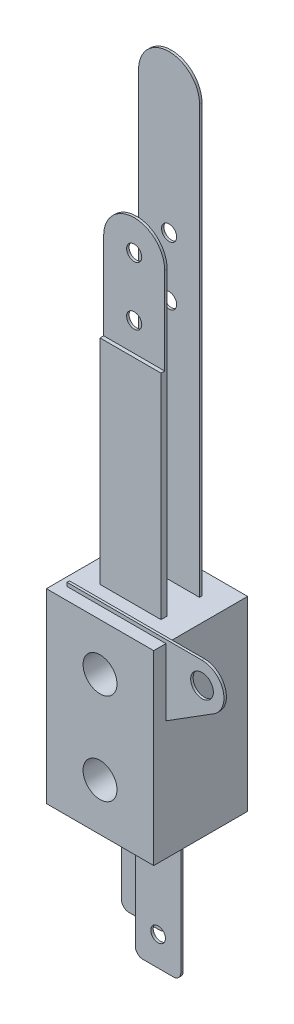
ISO-10303-21;
HEADER;
FILE_DESCRIPTION(('STEP AP214'),'2;1');
FILE_NAME('part.step','',(''),(''),'','','');
FILE_SCHEMA(('AUTOMOTIVE_DESIGN { 1 0 10303 214 1 1 1 1 }'));
ENDSEC;
DATA;
#1=APPLICATION_CONTEXT('core data for automotive mechanical design processes');
#2=APPLICATION_PROTOCOL_DEFINITION('international standard','automotive_design',2000,#1);
#3=PRODUCT_CONTEXT('',#1,'mechanical');
#4=PRODUCT('Part','Part','',(#3));
#5=PRODUCT_RELATED_PRODUCT_CATEGORY('part','',(#4));
#6=PRODUCT_DEFINITION_FORMATION('','',#4);
#7=PRODUCT_DEFINITION_CONTEXT('part definition',#1,'design');
#8=PRODUCT_DEFINITION('design','',#6,#7);
#9=PRODUCT_DEFINITION_SHAPE('','',#8);
#10=(LENGTH_UNIT() NAMED_UNIT(*) SI_UNIT(.MILLI.,.METRE.));
#11=(NAMED_UNIT(*) PLANE_ANGLE_UNIT() SI_UNIT($,.RADIAN.));
#12=(NAMED_UNIT(*) SI_UNIT($,.STERADIAN.) SOLID_ANGLE_UNIT());
#13=UNCERTAINTY_MEASURE_WITH_UNIT(LENGTH_MEASURE(1.E-05),#10,'distance_accuracy_value','');
#14=(GEOMETRIC_REPRESENTATION_CONTEXT(3) GLOBAL_UNCERTAINTY_ASSIGNED_CONTEXT((#13)) GLOBAL_UNIT_ASSIGNED_CONTEXT((#10,
#11,#12)) REPRESENTATION_CONTEXT('',''));
#15=CARTESIAN_POINT('',(0.,0.,0.));
#16=DIRECTION('',(0.,0.,1.));
#17=DIRECTION('',(1.,0.,0.));
#18=AXIS2_PLACEMENT_3D('',#15,#16,#17);
#19=CARTESIAN_POINT('',(-3.175,-10.6045,-3.81));
#20=DIRECTION('',(-1.,0.,0.));
#21=DIRECTION('',(0.,0.,1.));
#22=AXIS2_PLACEMENT_3D('',#19,#20,#21);
#23=PLANE('',#22);
#24=DIRECTION('',(0.,0.,1.));
#25=VECTOR('',#24,1.);
#26=CARTESIAN_POINT('',(-3.175,-10.6045,-3.81));
#27=LINE('',#26,#25);
#28=CARTESIAN_POINT('',(-3.175,-10.6045,-3.81));
#29=VERTEX_POINT('',#28);
#30=CARTESIAN_POINT('',(-3.175,-10.6045,-3.556));
#31=VERTEX_POINT('',#30);
#32=EDGE_CURVE('E329',#29,#31,#27,.T.);
#33=ORIENTED_EDGE('',*,*,#32,.T.);
#34=DIRECTION('',(0.,-1.,0.));
#35=VECTOR('',#34,1.);
#36=CARTESIAN_POINT('',(-3.175,-9.6901,-3.556));
#37=LINE('',#36,#35);
#38=CARTESIAN_POINT('',(-3.175,-9.6901,-3.556));
#39=VERTEX_POINT('',#38);
#40=EDGE_CURVE('E307',#39,#31,#37,.T.);
#41=ORIENTED_EDGE('',*,*,#40,.F.);
#42=DIRECTION('',(0.,0.,-1.));
#43=VECTOR('',#42,1.);
#44=CARTESIAN_POINT('',(-3.175,-9.6901,-9.779));
#45=LINE('',#44,#43);
#46=CARTESIAN_POINT('',(-3.175,-9.6901,-3.81));
#47=VERTEX_POINT('',#46);
#48=EDGE_CURVE('E332',#39,#47,#45,.T.);
#49=ORIENTED_EDGE('',*,*,#48,.T.);
#50=DIRECTION('',(0.,-1.,0.));
#51=VECTOR('',#50,1.);
#52=CARTESIAN_POINT('',(-3.175,-10.6045,-3.81));
#53=LINE('',#52,#51);
#54=EDGE_CURVE('E657',#47,#29,#53,.T.);
#55=ORIENTED_EDGE('',*,*,#54,.T.);
#56=EDGE_LOOP('',(#33,#41,#49,#55));
#57=FACE_BOUND('',#56,.T.);
#58=ADVANCED_FACE('F35',(#57),#23,.T.);
#59=CARTESIAN_POINT('',(4.8514,-6.73362366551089,-3.81));
#60=DIRECTION('',(1.,0.,0.));
#61=DIRECTION('',(0.,1.,0.));
#62=AXIS2_PLACEMENT_3D('',#59,#60,#61);
#63=PLANE('',#62);
#64=DIRECTION('',(0.,0.,1.));
#65=VECTOR('',#64,1.);
#66=CARTESIAN_POINT('',(4.8514,-9.6901,-9.779));
#67=LINE('',#66,#65);
#68=CARTESIAN_POINT('',(4.8514,-9.6901,-3.81));
#69=VERTEX_POINT('',#68);
#70=CARTESIAN_POINT('',(4.8514,-9.6901,-3.556));
#71=VERTEX_POINT('',#70);
#72=EDGE_CURVE('E463',#69,#71,#67,.T.);
#73=ORIENTED_EDGE('',*,*,#72,.T.);
#74=DIRECTION('',(0.,1.,0.));
#75=VECTOR('',#74,1.);
#76=CARTESIAN_POINT('',(4.8514,-21.5011,-3.556));
#77=LINE('',#76,#75);
#78=CARTESIAN_POINT('',(4.8514,-21.5011,-3.556));
#79=VERTEX_POINT('',#78);
#80=EDGE_CURVE('E565',#79,#71,#77,.T.);
#81=ORIENTED_EDGE('',*,*,#80,.F.);
#82=DIRECTION('',(0.,0.,1.));
#83=VECTOR('',#82,1.);
#84=CARTESIAN_POINT('',(4.8514,-21.5011,-3.81));
#85=LINE('',#84,#83);
#86=CARTESIAN_POINT('',(4.8514,-21.5011,-3.81));
#87=VERTEX_POINT('',#86);
#88=EDGE_CURVE('E11',#79,#87,#85,.F.);
#89=ORIENTED_EDGE('',*,*,#88,.T.);
#90=DIRECTION('',(0.,1.,0.));
#91=VECTOR('',#90,1.);
#92=CARTESIAN_POINT('',(4.8514,-6.73362366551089,-3.81));
#93=LINE('',#92,#91);
#94=EDGE_CURVE('E334',#87,#69,#93,.T.);
#95=ORIENTED_EDGE('',*,*,#94,.T.);
#96=EDGE_LOOP('',(#73,#81,#89,#95));
#97=FACE_BOUND('',#96,.T.);
#98=ADVANCED_FACE('F713',(#97),#63,.T.);
#99=CARTESIAN_POINT('',(0.127000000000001,-22.2631,-3.81));
#100=DIRECTION('',(0.,-1.,0.));
#101=DIRECTION('',(0.,0.,-1.));
#102=AXIS2_PLACEMENT_3D('',#99,#100,#101);
#103=PLANE('',#102);
#104=DIRECTION('',(0.,0.,1.));
#105=VECTOR('',#104,1.);
#106=CARTESIAN_POINT('',(4.0894,-22.2631,-3.81));
#107=LINE('',#106,#105);
#108=CARTESIAN_POINT('',(4.0894,-22.2631,-3.81));
#109=VERTEX_POINT('',#108);
#110=CARTESIAN_POINT('',(4.0894,-22.2631,-3.556));
#111=VERTEX_POINT('',#110);
#112=EDGE_CURVE('E543',#109,#111,#107,.T.);
#113=ORIENTED_EDGE('',*,*,#112,.T.);
#114=DIRECTION('',(1.,0.,0.));
#115=VECTOR('',#114,1.);
#116=CARTESIAN_POINT('',(0.889,-22.2631,-3.556));
#117=LINE('',#116,#115);
#118=CARTESIAN_POINT('',(0.889,-22.2631,-3.556));
#119=VERTEX_POINT('',#118);
#120=EDGE_CURVE('E50',#119,#111,#117,.T.);
#121=ORIENTED_EDGE('',*,*,#120,.F.);
#122=DIRECTION('',(0.,0.,1.));
#123=VECTOR('',#122,1.);
#124=CARTESIAN_POINT('',(0.889,-22.2631,-3.81));
#125=LINE('',#124,#123);
#126=CARTESIAN_POINT('',(0.889,-22.2631,-3.81));
#127=VERTEX_POINT('',#126);
#128=EDGE_CURVE('E546',#119,#127,#125,.F.);
#129=ORIENTED_EDGE('',*,*,#128,.T.);
#130=DIRECTION('',(1.,0.,0.));
#131=VECTOR('',#130,1.);
#132=CARTESIAN_POINT('',(0.127000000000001,-22.2631,-3.81));
#133=LINE('',#132,#131);
#134=EDGE_CURVE('E555',#127,#109,#133,.T.);
#135=ORIENTED_EDGE('',*,*,#134,.T.);
#136=EDGE_LOOP('',(#113,#121,#129,#135));
#137=FACE_BOUND('',#136,.T.);
#138=ADVANCED_FACE('F719',(#137),#103,.T.);
#139=CARTESIAN_POINT('',(0.127,-10.6045,-3.81));
#140=DIRECTION('',(-1.,0.,0.));
#141=DIRECTION('',(0.,-1.,0.));
#142=AXIS2_PLACEMENT_3D('',#139,#140,#141);
#143=PLANE('',#142);
#144=DIRECTION('',(0.,0.,1.));
#145=VECTOR('',#144,1.);
#146=CARTESIAN_POINT('',(0.127,-21.5011,-3.81));
#147=LINE('',#146,#145);
#148=CARTESIAN_POINT('',(0.127,-21.5011,-3.81));
#149=VERTEX_POINT('',#148);
#150=CARTESIAN_POINT('',(0.127,-21.5011,-3.556));
#151=VERTEX_POINT('',#150);
#152=EDGE_CURVE('E321',#149,#151,#147,.T.);
#153=ORIENTED_EDGE('',*,*,#152,.T.);
#154=DIRECTION('',(0.,-1.,0.));
#155=VECTOR('',#154,1.);
#156=CARTESIAN_POINT('',(0.127,-10.6045,-3.556));
#157=LINE('',#156,#155);
#158=CARTESIAN_POINT('',(0.127,-10.6045,-3.556));
#159=VERTEX_POINT('',#158);
#160=EDGE_CURVE('E304',#159,#151,#157,.T.);
#161=ORIENTED_EDGE('',*,*,#160,.F.);
#162=DIRECTION('',(0.,0.,1.));
#163=VECTOR('',#162,1.);
#164=CARTESIAN_POINT('',(0.127,-10.6045,-3.81));
#165=LINE('',#164,#163);
#166=CARTESIAN_POINT('',(0.127,-10.6045,-3.81));
#167=VERTEX_POINT('',#166);
#168=EDGE_CURVE('E318',#167,#159,#165,.T.);
#169=ORIENTED_EDGE('',*,*,#168,.F.);
#170=DIRECTION('',(0.,-1.,0.));
#171=VECTOR('',#170,1.);
#172=CARTESIAN_POINT('',(0.127,-10.6045,-3.81));
#173=LINE('',#172,#171);
#174=EDGE_CURVE('E553',#167,#149,#173,.T.);
#175=ORIENTED_EDGE('',*,*,#174,.T.);
#176=EDGE_LOOP('',(#153,#161,#169,#175));
#177=FACE_BOUND('',#176,.T.);
#178=ADVANCED_FACE('F316',(#177),#143,.T.);
#179=CARTESIAN_POINT('',(-3.175,-10.6045,-3.81));
#180=DIRECTION('',(0.,-1.,0.));
#181=DIRECTION('',(0.,0.,-1.));
#182=AXIS2_PLACEMENT_3D('',#179,#180,#181);
#183=PLANE('',#182);
#184=ORIENTED_EDGE('',*,*,#168,.T.);
#185=DIRECTION('',(1.,0.,0.));
#186=VECTOR('',#185,1.);
#187=CARTESIAN_POINT('',(-3.175,-10.6045,-3.556));
#188=LINE('',#187,#186);
#189=EDGE_CURVE('E301',#31,#159,#188,.T.);
#190=ORIENTED_EDGE('',*,*,#189,.F.);
#191=ORIENTED_EDGE('',*,*,#32,.F.);
#192=DIRECTION('',(1.,0.,0.));
#193=VECTOR('',#192,1.);
#194=CARTESIAN_POINT('',(-3.175,-10.6045,-3.81));
#195=LINE('',#194,#193);
#196=EDGE_CURVE('E327',#29,#167,#195,.T.);
#197=ORIENTED_EDGE('',*,*,#196,.T.);
#198=EDGE_LOOP('',(#184,#190,#191,#197));
#199=FACE_BOUND('',#198,.T.);
#200=ADVANCED_FACE('F325',(#199),#183,.T.);
#201=CARTESIAN_POINT('',(0.889,-21.5011,-3.81));
#202=DIRECTION('',(0.,0.,1.));
#203=DIRECTION('',(1.,0.,0.));
#204=AXIS2_PLACEMENT_3D('',#201,#202,#203);
#205=CYLINDRICAL_SURFACE('',#204,0.762);
#206=ORIENTED_EDGE('',*,*,#128,.F.);
#207=CARTESIAN_POINT('',(0.889,-21.5011,-3.556));
#208=DIRECTION('',(0.,0.,1.));
#209=DIRECTION('',(1.,0.,0.));
#210=AXIS2_PLACEMENT_3D('',#207,#208,#209);
#211=CIRCLE('',#210,0.761999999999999);
#212=EDGE_CURVE('E322',#151,#119,#211,.T.);
#213=ORIENTED_EDGE('',*,*,#212,.F.);
#214=ORIENTED_EDGE('',*,*,#152,.F.);
#215=CARTESIAN_POINT('',(0.889,-21.5011,-3.81));
#216=DIRECTION('',(0.,0.,-1.));
#217=DIRECTION('',(-1.,0.,0.));
#218=AXIS2_PLACEMENT_3D('',#215,#216,#217);
#219=CIRCLE('',#218,0.762);
#220=EDGE_CURVE('E43',#127,#149,#219,.T.);
#221=ORIENTED_EDGE('',*,*,#220,.F.);
#222=EDGE_LOOP('',(#206,#213,#214,#221));
#223=FACE_BOUND('',#222,.T.);
#224=ADVANCED_FACE('F559',(#223),#205,.T.);
#225=CARTESIAN_POINT('',(4.0894,-21.5011,-3.81));
#226=DIRECTION('',(0.,0.,1.));
#227=DIRECTION('',(1.,0.,0.));
#228=AXIS2_PLACEMENT_3D('',#225,#226,#227);
#229=CYLINDRICAL_SURFACE('',#228,0.762);
#230=ORIENTED_EDGE('',*,*,#88,.F.);
#231=CARTESIAN_POINT('',(4.0894,-21.5011,-3.556));
#232=DIRECTION('',(0.,0.,1.));
#233=DIRECTION('',(1.,0.,0.));
#234=AXIS2_PLACEMENT_3D('',#231,#232,#233);
#235=CIRCLE('',#234,0.761999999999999);
#236=EDGE_CURVE('E561',#111,#79,#235,.T.);
#237=ORIENTED_EDGE('',*,*,#236,.F.);
#238=ORIENTED_EDGE('',*,*,#112,.F.);
#239=CARTESIAN_POINT('',(4.0894,-21.5011,-3.81));
#240=DIRECTION('',(0.,0.,-1.));
#241=DIRECTION('',(-1.,0.,0.));
#242=AXIS2_PLACEMENT_3D('',#239,#240,#241);
#243=CIRCLE('',#242,0.762);
#244=EDGE_CURVE('E548',#87,#109,#243,.T.);
#245=ORIENTED_EDGE('',*,*,#244,.F.);
#246=EDGE_LOOP('',(#230,#237,#238,#245));
#247=FACE_BOUND('',#246,.T.);
#248=ADVANCED_FACE('F37',(#247),#229,.T.);
#249=CARTESIAN_POINT('',(5.588,-9.6901,-9.779));
#250=DIRECTION('',(1.,0.,0.));
#251=DIRECTION('',(0.,0.,-1.));
#252=AXIS2_PLACEMENT_3D('',#249,#250,#251);
#253=PLANE('',#252);
#254=DIRECTION('',(0.,1.,0.));
#255=VECTOR('',#254,1.);
#256=CARTESIAN_POINT('',(5.588,-9.6901,-1.524));
#257=LINE('',#256,#255);
#258=CARTESIAN_POINT('',(5.588,2.72525143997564,-1.524));
#259=VERTEX_POINT('',#258);
#260=CARTESIAN_POINT('',(5.588,9.6901,-1.524));
#261=VERTEX_POINT('',#260);
#262=EDGE_CURVE('E399',#259,#261,#257,.T.);
#263=ORIENTED_EDGE('',*,*,#262,.F.);
#264=DIRECTION('',(0.,0.,-1.));
#265=VECTOR('',#264,1.);
#266=CARTESIAN_POINT('',(5.588,2.72525143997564,-9.779));
#267=LINE('',#266,#265);
#268=CARTESIAN_POINT('',(5.588,2.72525143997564,-1.27));
#269=VERTEX_POINT('',#268);
#270=EDGE_CURVE('E450',#269,#259,#267,.T.);
#271=ORIENTED_EDGE('',*,*,#270,.F.);
#272=DIRECTION('',(0.,1.,0.));
#273=VECTOR('',#272,1.);
#274=CARTESIAN_POINT('',(5.588,-9.6901,-1.27));
#275=LINE('',#274,#273);
#276=CARTESIAN_POINT('',(5.588,9.6901,-1.27));
#277=VERTEX_POINT('',#276);
#278=EDGE_CURVE('E383',#269,#277,#275,.T.);
#279=ORIENTED_EDGE('',*,*,#278,.T.);
#280=DIRECTION('',(0.,0.,1.));
#281=VECTOR('',#280,1.);
#282=CARTESIAN_POINT('',(5.588,9.6901,-9.779));
#283=LINE('',#282,#281);
#284=CARTESIAN_POINT('',(5.588,9.6901,0.));
#285=VERTEX_POINT('',#284);
#286=EDGE_CURVE('E419',#277,#285,#283,.T.);
#287=ORIENTED_EDGE('',*,*,#286,.T.);
#288=DIRECTION('',(0.,1.,0.));
#289=VECTOR('',#288,1.);
#290=CARTESIAN_POINT('',(5.588,-9.6901,0.));
#291=LINE('',#290,#289);
#292=CARTESIAN_POINT('',(5.588,-9.6901,0.));
#293=VERTEX_POINT('',#292);
#294=EDGE_CURVE('E405',#293,#285,#291,.T.);
#295=ORIENTED_EDGE('',*,*,#294,.F.);
#296=DIRECTION('',(0.,0.,1.));
#297=VECTOR('',#296,1.);
#298=CARTESIAN_POINT('',(5.588,-9.6901,-9.779));
#299=LINE('',#298,#297);
#300=CARTESIAN_POINT('',(5.588,-9.6901,-9.779));
#301=VERTEX_POINT('',#300);
#302=EDGE_CURVE('E430',#301,#293,#299,.T.);
#303=ORIENTED_EDGE('',*,*,#302,.F.);
#304=DIRECTION('',(0.,1.,0.));
#305=VECTOR('',#304,1.);
#306=CARTESIAN_POINT('',(5.588,-9.6901,-9.779));
#307=LINE('',#306,#305);
#308=CARTESIAN_POINT('',(5.588,9.6901,-9.779));
#309=VERTEX_POINT('',#308);
#310=EDGE_CURVE('E406',#301,#309,#307,.T.);
#311=ORIENTED_EDGE('',*,*,#310,.T.);
#312=EDGE_CURVE('E437',#309,#261,#283,.T.);
#313=ORIENTED_EDGE('',*,*,#312,.T.);
#314=EDGE_LOOP('',(#263,#271,#279,#287,#295,#303,#311,#313));
#315=FACE_BOUND('',#314,.T.);
#316=ADVANCED_FACE('F750',(#315),#253,.T.);
#317=CARTESIAN_POINT('',(-5.588,-9.6901,-9.779));
#318=DIRECTION('',(0.,-1.,0.));
#319=DIRECTION('',(0.,0.,-1.));
#320=AXIS2_PLACEMENT_3D('',#317,#318,#319);
#321=PLANE('',#320);
#322=ORIENTED_EDGE('',*,*,#48,.F.);
#323=DIRECTION('',(-1.,0.,0.));
#324=VECTOR('',#323,1.);
#325=CARTESIAN_POINT('',(4.8514,-9.6901,-3.556));
#326=LINE('',#325,#324);
#327=EDGE_CURVE('E568',#71,#39,#326,.T.);
#328=ORIENTED_EDGE('',*,*,#327,.F.);
#329=ORIENTED_EDGE('',*,*,#72,.F.);
#330=DIRECTION('',(1.,0.,0.));
#331=VECTOR('',#330,1.);
#332=CARTESIAN_POINT('',(-5.588,-9.6901,-3.81));
#333=LINE('',#332,#331);
#334=EDGE_CURVE('E328',#47,#69,#333,.T.);
#335=ORIENTED_EDGE('',*,*,#334,.F.);
#336=EDGE_LOOP('',(#322,#328,#329,#335));
#337=FACE_BOUND('',#336,.T.);
#338=DIRECTION('',(1.,0.,0.));
#339=VECTOR('',#338,1.);
#340=CARTESIAN_POINT('',(-5.588,-9.6901,-7.4422));
#341=LINE('',#340,#339);
#342=CARTESIAN_POINT('',(-4.953,-9.6901,-7.4422));
#343=VERTEX_POINT('',#342);
#344=CARTESIAN_POINT('',(3.175,-9.6901,-7.4422));
#345=VERTEX_POINT('',#344);
#346=EDGE_CURVE('E637',#343,#345,#341,.T.);
#347=ORIENTED_EDGE('',*,*,#346,.F.);
#348=DIRECTION('',(0.,0.,-1.));
#349=VECTOR('',#348,1.);
#350=CARTESIAN_POINT('',(-4.953,-9.6901,-9.779));
#351=LINE('',#350,#349);
#352=CARTESIAN_POINT('',(-4.953,-9.6901,-7.1882));
#353=VERTEX_POINT('',#352);
#354=EDGE_CURVE('E495',#353,#343,#351,.T.);
#355=ORIENTED_EDGE('',*,*,#354,.F.);
#356=DIRECTION('',(1.,0.,0.));
#357=VECTOR('',#356,1.);
#358=CARTESIAN_POINT('',(-5.588,-9.6901,-7.1882));
#359=LINE('',#358,#357);
#360=CARTESIAN_POINT('',(3.175,-9.6901,-7.1882));
#361=VERTEX_POINT('',#360);
#362=EDGE_CURVE('E632',#353,#361,#359,.T.);
#363=ORIENTED_EDGE('',*,*,#362,.T.);
#364=DIRECTION('',(0.,0.,1.));
#365=VECTOR('',#364,1.);
#366=CARTESIAN_POINT('',(3.175,-9.6901,-9.779));
#367=LINE('',#366,#365);
#368=EDGE_CURVE('E639',#345,#361,#367,.T.);
#369=ORIENTED_EDGE('',*,*,#368,.F.);
#370=EDGE_LOOP('',(#347,#355,#363,#369));
#371=FACE_BOUND('',#370,.T.);
#372=DIRECTION('',(1.,0.,0.));
#373=VECTOR('',#372,1.);
#374=CARTESIAN_POINT('',(-5.588,-9.6901,-1.524));
#375=LINE('',#374,#373);
#376=CARTESIAN_POINT('',(-4.699,-9.6901,-1.524));
#377=VERTEX_POINT('',#376);
#378=CARTESIAN_POINT('',(3.048,-9.6901,-1.524));
#379=VERTEX_POINT('',#378);
#380=EDGE_CURVE('E401',#377,#379,#375,.T.);
#381=ORIENTED_EDGE('',*,*,#380,.F.);
#382=DIRECTION('',(0.,0.,-1.));
#383=VECTOR('',#382,1.);
#384=CARTESIAN_POINT('',(-4.699,-9.6901,-9.779));
#385=LINE('',#384,#383);
#386=CARTESIAN_POINT('',(-4.699,-9.6901,-1.27));
#387=VERTEX_POINT('',#386);
#388=EDGE_CURVE('E403',#387,#377,#385,.T.);
#389=ORIENTED_EDGE('',*,*,#388,.F.);
#390=DIRECTION('',(1.,0.,0.));
#391=VECTOR('',#390,1.);
#392=CARTESIAN_POINT('',(-5.588,-9.6901,-1.27));
#393=LINE('',#392,#391);
#394=CARTESIAN_POINT('',(3.048,-9.6901,-1.27));
#395=VERTEX_POINT('',#394);
#396=EDGE_CURVE('E396',#387,#395,#393,.T.);
#397=ORIENTED_EDGE('',*,*,#396,.T.);
#398=DIRECTION('',(0.,0.,1.));
#399=VECTOR('',#398,1.);
#400=CARTESIAN_POINT('',(3.048,-9.6901,-9.779));
#401=LINE('',#400,#399);
#402=EDGE_CURVE('E447',#379,#395,#401,.T.);
#403=ORIENTED_EDGE('',*,*,#402,.F.);
#404=EDGE_LOOP('',(#381,#389,#397,#403));
#405=FACE_BOUND('',#404,.T.);
#406=DIRECTION('',(1.,0.,0.));
#407=VECTOR('',#406,1.);
#408=CARTESIAN_POINT('',(-5.588,-9.6901,0.));
#409=LINE('',#408,#407);
#410=CARTESIAN_POINT('',(-5.588,-9.6901,0.));
#411=VERTEX_POINT('',#410);
#412=EDGE_CURVE('E410',#411,#293,#409,.T.);
#413=ORIENTED_EDGE('',*,*,#412,.F.);
#414=DIRECTION('',(0.,0.,1.));
#415=VECTOR('',#414,1.);
#416=CARTESIAN_POINT('',(-5.588,-9.6901,-9.779));
#417=LINE('',#416,#415);
#418=CARTESIAN_POINT('',(-5.588,-9.6901,-9.779));
#419=VERTEX_POINT('',#418);
#420=EDGE_CURVE('E433',#419,#411,#417,.T.);
#421=ORIENTED_EDGE('',*,*,#420,.F.);
#422=DIRECTION('',(1.,0.,0.));
#423=VECTOR('',#422,1.);
#424=CARTESIAN_POINT('',(-5.588,-9.6901,-9.779));
#425=LINE('',#424,#423);
#426=EDGE_CURVE('E416',#419,#301,#425,.T.);
#427=ORIENTED_EDGE('',*,*,#426,.T.);
#428=ORIENTED_EDGE('',*,*,#302,.T.);
#429=EDGE_LOOP('',(#413,#421,#427,#428));
#430=FACE_BOUND('',#429,.T.);
#431=ADVANCED_FACE('F876',(#337,#371,#405,#430),#321,.T.);
#432=CARTESIAN_POINT('',(-5.588,-9.6901,-9.779));
#433=DIRECTION('',(-1.,0.,0.));
#434=DIRECTION('',(0.,0.,1.));
#435=AXIS2_PLACEMENT_3D('',#432,#433,#434);
#436=PLANE('',#435);
#437=DIRECTION('',(0.,-1.,0.));
#438=VECTOR('',#437,1.);
#439=CARTESIAN_POINT('',(-5.588,-9.6901,0.));
#440=LINE('',#439,#438);
#441=CARTESIAN_POINT('',(-5.588,9.6901,0.));
#442=VERTEX_POINT('',#441);
#443=EDGE_CURVE('E425',#442,#411,#440,.T.);
#444=ORIENTED_EDGE('',*,*,#443,.F.);
#445=DIRECTION('',(0.,0.,1.));
#446=VECTOR('',#445,1.);
#447=CARTESIAN_POINT('',(-5.588,9.6901,-9.779));
#448=LINE('',#447,#446);
#449=CARTESIAN_POINT('',(-5.588,9.6901,-9.779));
#450=VERTEX_POINT('',#449);
#451=EDGE_CURVE('E435',#450,#442,#448,.T.);
#452=ORIENTED_EDGE('',*,*,#451,.F.);
#453=DIRECTION('',(0.,-1.,0.));
#454=VECTOR('',#453,1.);
#455=CARTESIAN_POINT('',(-5.588,-9.6901,-9.779));
#456=LINE('',#455,#454);
#457=EDGE_CURVE('E413',#450,#419,#456,.T.);
#458=ORIENTED_EDGE('',*,*,#457,.T.);
#459=ORIENTED_EDGE('',*,*,#420,.T.);
#460=EDGE_LOOP('',(#444,#452,#458,#459));
#461=FACE_BOUND('',#460,.T.);
#462=ADVANCED_FACE('F945',(#461),#436,.T.);
#463=CARTESIAN_POINT('',(-5.588,9.6901,-9.779));
#464=DIRECTION('',(0.,1.,0.));
#465=DIRECTION('',(0.,0.,1.));
#466=AXIS2_PLACEMENT_3D('',#463,#464,#465);
#467=PLANE('',#466);
#468=DIRECTION('',(-1.,0.,0.));
#469=VECTOR('',#468,1.);
#470=CARTESIAN_POINT('',(-5.588,9.6901,-7.4422));
#471=LINE('',#470,#469);
#472=CARTESIAN_POINT('',(3.175,9.6901,-7.4422));
#473=VERTEX_POINT('',#472);
#474=CARTESIAN_POINT('',(-3.175,9.6901,-7.4422));
#475=VERTEX_POINT('',#474);
#476=EDGE_CURVE('E492',#473,#475,#471,.T.);
#477=ORIENTED_EDGE('',*,*,#476,.F.);
#478=DIRECTION('',(0.,0.,-1.));
#479=VECTOR('',#478,1.);
#480=CARTESIAN_POINT('',(3.175,9.6901,-9.779));
#481=LINE('',#480,#479);
#482=CARTESIAN_POINT('',(3.175,9.6901,-7.1882));
#483=VERTEX_POINT('',#482);
#484=EDGE_CURVE('E490',#483,#473,#481,.T.);
#485=ORIENTED_EDGE('',*,*,#484,.F.);
#486=DIRECTION('',(-1.,0.,0.));
#487=VECTOR('',#486,1.);
#488=CARTESIAN_POINT('',(-5.588,9.6901,-7.1882));
#489=LINE('',#488,#487);
#490=CARTESIAN_POINT('',(-3.175,9.6901,-7.1882));
#491=VERTEX_POINT('',#490);
#492=EDGE_CURVE('E484',#483,#491,#489,.T.);
#493=ORIENTED_EDGE('',*,*,#492,.T.);
#494=DIRECTION('',(0.,0.,1.));
#495=VECTOR('',#494,1.);
#496=CARTESIAN_POINT('',(-3.175,9.6901,-9.779));
#497=LINE('',#496,#495);
#498=EDGE_CURVE('E487',#475,#491,#497,.T.);
#499=ORIENTED_EDGE('',*,*,#498,.F.);
#500=EDGE_LOOP('',(#477,#485,#493,#499));
#501=FACE_BOUND('',#500,.T.);
#502=DIRECTION('',(-1.,0.,0.));
#503=VECTOR('',#502,1.);
#504=CARTESIAN_POINT('',(-5.588,9.6901,-3.81));
#505=LINE('',#504,#503);
#506=CARTESIAN_POINT('',(3.175,9.6901,-3.81));
#507=VERTEX_POINT('',#506);
#508=CARTESIAN_POINT('',(-3.175,9.6901,-3.81));
#509=VERTEX_POINT('',#508);
#510=EDGE_CURVE('E460',#507,#509,#505,.T.);
#511=ORIENTED_EDGE('',*,*,#510,.F.);
#512=DIRECTION('',(0.,0.,-1.));
#513=VECTOR('',#512,1.);
#514=CARTESIAN_POINT('',(3.175,9.6901,-9.779));
#515=LINE('',#514,#513);
#516=CARTESIAN_POINT('',(3.175,9.6901,-3.175));
#517=VERTEX_POINT('',#516);
#518=EDGE_CURVE('E458',#517,#507,#515,.T.);
#519=ORIENTED_EDGE('',*,*,#518,.F.);
#520=DIRECTION('',(-1.,0.,0.));
#521=VECTOR('',#520,1.);
#522=CARTESIAN_POINT('',(-5.588,9.6901,-3.175));
#523=LINE('',#522,#521);
#524=CARTESIAN_POINT('',(-3.175,9.6901,-3.175));
#525=VERTEX_POINT('',#524);
#526=EDGE_CURVE('E452',#517,#525,#523,.T.);
#527=ORIENTED_EDGE('',*,*,#526,.T.);
#528=DIRECTION('',(0.,0.,1.));
#529=VECTOR('',#528,1.);
#530=CARTESIAN_POINT('',(-3.175,9.6901,-9.779));
#531=LINE('',#530,#529);
#532=EDGE_CURVE('E455',#509,#525,#531,.T.);
#533=ORIENTED_EDGE('',*,*,#532,.F.);
#534=EDGE_LOOP('',(#511,#519,#527,#533));
#535=FACE_BOUND('',#534,.T.);
#536=DIRECTION('',(-1.,0.,0.));
#537=VECTOR('',#536,1.);
#538=CARTESIAN_POINT('',(-5.588,9.6901,-1.524));
#539=LINE('',#538,#537);
#540=CARTESIAN_POINT('',(-4.699,9.6901,-1.524));
#541=VERTEX_POINT('',#540);
#542=EDGE_CURVE('E445',#261,#541,#539,.T.);
#543=ORIENTED_EDGE('',*,*,#542,.F.);
#544=ORIENTED_EDGE('',*,*,#312,.F.);
#545=DIRECTION('',(-1.,0.,0.));
#546=VECTOR('',#545,1.);
#547=CARTESIAN_POINT('',(-5.588,9.6901,-9.779));
#548=LINE('',#547,#546);
#549=EDGE_CURVE('E409',#309,#450,#548,.T.);
#550=ORIENTED_EDGE('',*,*,#549,.T.);
#551=ORIENTED_EDGE('',*,*,#451,.T.);
#552=DIRECTION('',(-1.,0.,0.));
#553=VECTOR('',#552,1.);
#554=CARTESIAN_POINT('',(-5.588,9.6901,0.));
#555=LINE('',#554,#553);
#556=EDGE_CURVE('E422',#285,#442,#555,.T.);
#557=ORIENTED_EDGE('',*,*,#556,.F.);
#558=ORIENTED_EDGE('',*,*,#286,.F.);
#559=DIRECTION('',(-1.,0.,0.));
#560=VECTOR('',#559,1.);
#561=CARTESIAN_POINT('',(-5.588,9.6901,-1.27));
#562=LINE('',#561,#560);
#563=CARTESIAN_POINT('',(-4.699,9.6901,-1.27));
#564=VERTEX_POINT('',#563);
#565=EDGE_CURVE('E432',#277,#564,#562,.T.);
#566=ORIENTED_EDGE('',*,*,#565,.T.);
#567=DIRECTION('',(0.,0.,1.));
#568=VECTOR('',#567,1.);
#569=CARTESIAN_POINT('',(-4.699,9.6901,-9.779));
#570=LINE('',#569,#568);
#571=EDGE_CURVE('E442',#541,#564,#570,.T.);
#572=ORIENTED_EDGE('',*,*,#571,.F.);
#573=EDGE_LOOP('',(#543,#544,#550,#551,#557,#558,#566,#572));
#574=FACE_BOUND('',#573,.T.);
#575=ADVANCED_FACE('F676',(#501,#535,#574),#467,.T.);
#576=CARTESIAN_POINT('',(0.,0.,-9.779));
#577=DIRECTION('',(0.,0.,-1.));
#578=DIRECTION('',(-1.,0.,0.));
#579=AXIS2_PLACEMENT_3D('',#576,#577,#578);
#580=PLANE('',#579);
#581=CARTESIAN_POINT('',(0.,-4.7625,-9.779));
#582=DIRECTION('',(0.,0.,1.));
#583=DIRECTION('',(1.,0.,0.));
#584=AXIS2_PLACEMENT_3D('',#581,#582,#583);
#585=CIRCLE('',#584,1.7653);
#586=CARTESIAN_POINT('',(1.7653,-4.7625,-9.779));
#587=VERTEX_POINT('',#586);
#588=EDGE_CURVE('E571',#587,#587,#585,.T.);
#589=ORIENTED_EDGE('',*,*,#588,.T.);
#590=EDGE_LOOP('',(#589));
#591=FACE_BOUND('',#590,.T.);
#592=CARTESIAN_POINT('',(0.,4.7625,-9.779));
#593=DIRECTION('',(0.,0.,1.));
#594=DIRECTION('',(1.,0.,0.));
#595=AXIS2_PLACEMENT_3D('',#592,#593,#594);
#596=CIRCLE('',#595,1.7653);
#597=CARTESIAN_POINT('',(1.7653,4.7625,-9.779));
#598=VERTEX_POINT('',#597);
#599=EDGE_CURVE('E577',#598,#598,#596,.T.);
#600=ORIENTED_EDGE('',*,*,#599,.T.);
#601=EDGE_LOOP('',(#600));
#602=FACE_BOUND('',#601,.T.);
#603=ORIENTED_EDGE('',*,*,#310,.F.);
#604=ORIENTED_EDGE('',*,*,#426,.F.);
#605=ORIENTED_EDGE('',*,*,#457,.F.);
#606=ORIENTED_EDGE('',*,*,#549,.F.);
#607=EDGE_LOOP('',(#603,#604,#605,#606));
#608=FACE_BOUND('',#607,.T.);
#609=ADVANCED_FACE('F929',(#591,#602,#608),#580,.T.);
#610=CARTESIAN_POINT('',(0.,0.,0.));
#611=DIRECTION('',(0.,0.,-1.));
#612=DIRECTION('',(-1.,0.,0.));
#613=AXIS2_PLACEMENT_3D('',#610,#611,#612);
#614=PLANE('',#613);
#615=CARTESIAN_POINT('',(0.,-4.7625,0.));
#616=DIRECTION('',(0.,0.,1.));
#617=DIRECTION('',(1.,0.,0.));
#618=AXIS2_PLACEMENT_3D('',#615,#616,#617);
#619=CIRCLE('',#618,1.7653);
#620=CARTESIAN_POINT('',(1.7653,-4.7625,0.));
#621=VERTEX_POINT('',#620);
#622=EDGE_CURVE('E524',#621,#621,#619,.T.);
#623=ORIENTED_EDGE('',*,*,#622,.F.);
#624=EDGE_LOOP('',(#623));
#625=FACE_BOUND('',#624,.T.);
#626=CARTESIAN_POINT('',(0.,4.7625,0.));
#627=DIRECTION('',(0.,0.,1.));
#628=DIRECTION('',(1.,0.,0.));
#629=AXIS2_PLACEMENT_3D('',#626,#627,#628);
#630=CIRCLE('',#629,1.7653);
#631=CARTESIAN_POINT('',(1.7653,4.7625,0.));
#632=VERTEX_POINT('',#631);
#633=EDGE_CURVE('E574',#632,#632,#630,.T.);
#634=ORIENTED_EDGE('',*,*,#633,.F.);
#635=EDGE_LOOP('',(#634));
#636=FACE_BOUND('',#635,.T.);
#637=ORIENTED_EDGE('',*,*,#294,.T.);
#638=ORIENTED_EDGE('',*,*,#556,.T.);
#639=ORIENTED_EDGE('',*,*,#443,.T.);
#640=ORIENTED_EDGE('',*,*,#412,.T.);
#641=EDGE_LOOP('',(#637,#638,#639,#640));
#642=FACE_BOUND('',#641,.T.);
#643=ADVANCED_FACE('F925',(#625,#636,#642),#614,.F.);
#644=CARTESIAN_POINT('',(-4.699,10.0711,-1.524));
#645=DIRECTION('',(0.,1.,0.));
#646=DIRECTION('',(0.,0.,1.));
#647=AXIS2_PLACEMENT_3D('',#644,#645,#646);
#648=PLANE('',#647);
#649=DIRECTION('',(-1.,0.,0.));
#650=VECTOR('',#649,1.);
#651=CARTESIAN_POINT('',(-4.699,10.0711,-1.27));
#652=LINE('',#651,#650);
#653=CARTESIAN_POINT('',(9.3472,10.0711,-1.27));
#654=VERTEX_POINT('',#653);
#655=CARTESIAN_POINT('',(-4.699,10.0711,-1.27));
#656=VERTEX_POINT('',#655);
#657=EDGE_CURVE('E378',#654,#656,#652,.T.);
#658=ORIENTED_EDGE('',*,*,#657,.F.);
#659=DIRECTION('',(0.,0.,1.));
#660=VECTOR('',#659,1.);
#661=CARTESIAN_POINT('',(9.3472,10.0711,-1.524));
#662=LINE('',#661,#660);
#663=CARTESIAN_POINT('',(9.3472,10.0711,-1.524));
#664=VERTEX_POINT('',#663);
#665=EDGE_CURVE('E384',#664,#654,#662,.T.);
#666=ORIENTED_EDGE('',*,*,#665,.F.);
#667=DIRECTION('',(-1.,0.,0.));
#668=VECTOR('',#667,1.);
#669=CARTESIAN_POINT('',(3.048,10.0711,-1.524));
#670=LINE('',#669,#668);
#671=CARTESIAN_POINT('',(-4.699,10.0711,-1.524));
#672=VERTEX_POINT('',#671);
#673=EDGE_CURVE('E363',#664,#672,#670,.T.);
#674=ORIENTED_EDGE('',*,*,#673,.T.);
#675=DIRECTION('',(0.,0.,1.));
#676=VECTOR('',#675,1.);
#677=CARTESIAN_POINT('',(-4.699,10.0711,-1.524));
#678=LINE('',#677,#676);
#679=EDGE_CURVE('E381',#672,#656,#678,.T.);
#680=ORIENTED_EDGE('',*,*,#679,.T.);
#681=EDGE_LOOP('',(#658,#666,#674,#680));
#682=FACE_BOUND('',#681,.T.);
#683=ADVANCED_FACE('F928',(#682),#648,.T.);
#684=CARTESIAN_POINT('',(9.3472,7.7851,-1.524));
#685=DIRECTION('',(0.,0.,1.));
#686=DIRECTION('',(1.,0.,0.));
#687=AXIS2_PLACEMENT_3D('',#684,#685,#686);
#688=CYLINDRICAL_SURFACE('',#687,2.286);
#689=CARTESIAN_POINT('',(9.3472,7.7851,-1.27));
#690=DIRECTION('',(0.,0.,1.));
#691=DIRECTION('',(-1.,0.,0.));
#692=AXIS2_PLACEMENT_3D('',#689,#690,#691);
#693=CIRCLE('',#692,2.286);
#694=CARTESIAN_POINT('',(10.5628589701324,5.84913273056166,-1.27));
#695=VERTEX_POINT('',#694);
#696=EDGE_CURVE('E375',#695,#654,#693,.T.);
#697=ORIENTED_EDGE('',*,*,#696,.F.);
#698=DIRECTION('',(0.,0.,1.));
#699=VECTOR('',#698,1.);
#700=CARTESIAN_POINT('',(10.5628589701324,5.84913273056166,-1.524));
#701=LINE('',#700,#699);
#702=CARTESIAN_POINT('',(10.5628589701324,5.84913273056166,-1.524));
#703=VERTEX_POINT('',#702);
#704=EDGE_CURVE('E387',#703,#695,#701,.T.);
#705=ORIENTED_EDGE('',*,*,#704,.F.);
#706=CARTESIAN_POINT('',(9.3472,7.7851,-1.524));
#707=DIRECTION('',(0.,0.,1.));
#708=DIRECTION('',(-1.,0.,0.));
#709=AXIS2_PLACEMENT_3D('',#706,#707,#708);
#710=CIRCLE('',#709,2.286);
#711=EDGE_CURVE('E360',#703,#664,#710,.T.);
#712=ORIENTED_EDGE('',*,*,#711,.T.);
#713=ORIENTED_EDGE('',*,*,#665,.T.);
#714=EDGE_LOOP('',(#697,#705,#712,#713));
#715=FACE_BOUND('',#714,.T.);
#716=ADVANCED_FACE('F964',(#715),#688,.T.);
#717=CARTESIAN_POINT('',(9.3472,7.7851,-1.27));
#718=DIRECTION('',(0.,0.,-1.));
#719=DIRECTION('',(-1.,0.,0.));
#720=AXIS2_PLACEMENT_3D('',#717,#718,#719);
#721=PLANE('',#720);
#722=CARTESIAN_POINT('',(9.3472,7.7851,-1.27));
#723=DIRECTION('',(0.,0.,1.));
#724=DIRECTION('',(1.,0.,0.));
#725=AXIS2_PLACEMENT_3D('',#722,#723,#724);
#726=CIRCLE('',#725,1.1811);
#727=CARTESIAN_POINT('',(10.5283,7.7851,-1.27));
#728=VERTEX_POINT('',#727);
#729=EDGE_CURVE('E341',#728,#728,#726,.T.);
#730=ORIENTED_EDGE('',*,*,#729,.F.);
#731=EDGE_LOOP('',(#730));
#732=FACE_BOUND('',#731,.T.);
#733=ORIENTED_EDGE('',*,*,#278,.F.);
#734=DIRECTION('',(0.846879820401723,0.531784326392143,0.));
#735=VECTOR('',#734,1.);
#736=CARTESIAN_POINT('',(3.048,1.1303,-1.27));
#737=LINE('',#736,#735);
#738=EDGE_CURVE('E373',#269,#695,#737,.T.);
#739=ORIENTED_EDGE('',*,*,#738,.T.);
#740=ORIENTED_EDGE('',*,*,#696,.T.);
#741=ORIENTED_EDGE('',*,*,#657,.T.);
#742=DIRECTION('',(0.,-1.,0.));
#743=VECTOR('',#742,1.);
#744=CARTESIAN_POINT('',(-4.699,10.0711,-1.27));
#745=LINE('',#744,#743);
#746=EDGE_CURVE('E366',#656,#564,#745,.T.);
#747=ORIENTED_EDGE('',*,*,#746,.T.);
#748=ORIENTED_EDGE('',*,*,#565,.F.);
#749=EDGE_LOOP('',(#733,#739,#740,#741,#747,#748));
#750=FACE_BOUND('',#749,.T.);
#751=ADVANCED_FACE('F969',(#732,#750),#721,.F.);
#752=CARTESIAN_POINT('',(9.3472,7.7851,-1.524));
#753=DIRECTION('',(0.,0.,-1.));
#754=DIRECTION('',(-1.,0.,0.));
#755=AXIS2_PLACEMENT_3D('',#752,#753,#754);
#756=PLANE('',#755);
#757=CARTESIAN_POINT('',(9.3472,7.7851,-1.524));
#758=DIRECTION('',(0.,0.,1.));
#759=DIRECTION('',(1.,0.,0.));
#760=AXIS2_PLACEMENT_3D('',#757,#758,#759);
#761=CIRCLE('',#760,1.1811);
#762=CARTESIAN_POINT('',(10.5283,7.7851,-1.524));
#763=VERTEX_POINT('',#762);
#764=EDGE_CURVE('E342',#763,#763,#761,.T.);
#765=ORIENTED_EDGE('',*,*,#764,.T.);
#766=EDGE_LOOP('',(#765));
#767=FACE_BOUND('',#766,.T.);
#768=DIRECTION('',(0.846879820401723,0.531784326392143,0.));
#769=VECTOR('',#768,1.);
#770=CARTESIAN_POINT('',(3.048,1.1303,-1.524));
#771=LINE('',#770,#769);
#772=EDGE_CURVE('E358',#259,#703,#771,.T.);
#773=ORIENTED_EDGE('',*,*,#772,.F.);
#774=ORIENTED_EDGE('',*,*,#262,.T.);
#775=ORIENTED_EDGE('',*,*,#542,.T.);
#776=DIRECTION('',(0.,-1.,0.));
#777=VECTOR('',#776,1.);
#778=CARTESIAN_POINT('',(-4.699,10.0711,-1.524));
#779=LINE('',#778,#777);
#780=EDGE_CURVE('E348',#672,#541,#779,.T.);
#781=ORIENTED_EDGE('',*,*,#780,.F.);
#782=ORIENTED_EDGE('',*,*,#673,.F.);
#783=ORIENTED_EDGE('',*,*,#711,.F.);
#784=EDGE_LOOP('',(#773,#774,#775,#781,#782,#783));
#785=FACE_BOUND('',#784,.T.);
#786=ADVANCED_FACE('F953',(#767,#785),#756,.T.);
#787=CARTESIAN_POINT('',(-4.699,10.0711,-1.524));
#788=DIRECTION('',(-1.,0.,0.));
#789=DIRECTION('',(0.,-1.,0.));
#790=AXIS2_PLACEMENT_3D('',#787,#788,#789);
#791=PLANE('',#790);
#792=ORIENTED_EDGE('',*,*,#780,.T.);
#793=ORIENTED_EDGE('',*,*,#571,.T.);
#794=ORIENTED_EDGE('',*,*,#746,.F.);
#795=ORIENTED_EDGE('',*,*,#679,.F.);
#796=EDGE_LOOP('',(#792,#793,#794,#795));
#797=FACE_BOUND('',#796,.T.);
#798=ADVANCED_FACE('F957',(#797),#791,.T.);
#799=CARTESIAN_POINT('',(3.048,1.1303,-1.524));
#800=DIRECTION('',(0.531784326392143,-0.846879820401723,0.));
#801=DIRECTION('',(0.846879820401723,0.531784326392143,0.));
#802=AXIS2_PLACEMENT_3D('',#799,#800,#801);
#803=PLANE('',#802);
#804=ORIENTED_EDGE('',*,*,#738,.F.);
#805=ORIENTED_EDGE('',*,*,#270,.T.);
#806=ORIENTED_EDGE('',*,*,#772,.T.);
#807=ORIENTED_EDGE('',*,*,#704,.T.);
#808=EDGE_LOOP('',(#804,#805,#806,#807));
#809=FACE_BOUND('',#808,.T.);
#810=ADVANCED_FACE('F967',(#809),#803,.T.);
#811=CARTESIAN_POINT('',(-4.699,-10.2997,-1.27));
#812=VERTEX_POINT('',#811);
#813=EDGE_CURVE('E345',#387,#812,#745,.T.);
#814=ORIENTED_EDGE('',*,*,#813,.F.);
#815=ORIENTED_EDGE('',*,*,#388,.T.);
#816=CARTESIAN_POINT('',(-4.699,-10.2997,-1.524));
#817=VERTEX_POINT('',#816);
#818=EDGE_CURVE('E352',#377,#817,#779,.T.);
#819=ORIENTED_EDGE('',*,*,#818,.T.);
#820=DIRECTION('',(0.,0.,1.));
#821=VECTOR('',#820,1.);
#822=CARTESIAN_POINT('',(-4.699,-10.2997,-1.524));
#823=LINE('',#822,#821);
#824=EDGE_CURVE('E365',#817,#812,#823,.T.);
#825=ORIENTED_EDGE('',*,*,#824,.T.);
#826=EDGE_LOOP('',(#814,#815,#819,#825));
#827=FACE_BOUND('',#826,.T.);
#828=ADVANCED_FACE('F994',(#827),#791,.T.);
#829=ORIENTED_EDGE('',*,*,#818,.F.);
#830=ORIENTED_EDGE('',*,*,#380,.T.);
#831=DIRECTION('',(0.,1.,0.));
#832=VECTOR('',#831,1.);
#833=CARTESIAN_POINT('',(3.048,1.1303,-1.524));
#834=LINE('',#833,#832);
#835=CARTESIAN_POINT('',(3.048,-10.2997,-1.524));
#836=VERTEX_POINT('',#835);
#837=EDGE_CURVE('E355',#836,#379,#834,.T.);
#838=ORIENTED_EDGE('',*,*,#837,.F.);
#839=DIRECTION('',(1.,0.,0.));
#840=VECTOR('',#839,1.);
#841=CARTESIAN_POINT('',(-4.699,-10.2997,-1.524));
#842=LINE('',#841,#840);
#843=EDGE_CURVE('E351',#817,#836,#842,.T.);
#844=ORIENTED_EDGE('',*,*,#843,.F.);
#845=EDGE_LOOP('',(#829,#830,#838,#844));
#846=FACE_BOUND('',#845,.T.);
#847=ADVANCED_FACE('F980',(#846),#756,.T.);
#848=ORIENTED_EDGE('',*,*,#396,.F.);
#849=ORIENTED_EDGE('',*,*,#813,.T.);
#850=DIRECTION('',(1.,0.,0.));
#851=VECTOR('',#850,1.);
#852=CARTESIAN_POINT('',(-4.699,-10.2997,-1.27));
#853=LINE('',#852,#851);
#854=CARTESIAN_POINT('',(3.048,-10.2997,-1.27));
#855=VERTEX_POINT('',#854);
#856=EDGE_CURVE('E368',#812,#855,#853,.T.);
#857=ORIENTED_EDGE('',*,*,#856,.T.);
#858=DIRECTION('',(0.,1.,0.));
#859=VECTOR('',#858,1.);
#860=CARTESIAN_POINT('',(3.048,1.1303,-1.27));
#861=LINE('',#860,#859);
#862=EDGE_CURVE('E371',#855,#395,#861,.T.);
#863=ORIENTED_EDGE('',*,*,#862,.T.);
#864=EDGE_LOOP('',(#848,#849,#857,#863));
#865=FACE_BOUND('',#864,.T.);
#866=ADVANCED_FACE('F973',(#865),#721,.F.);
#867=CARTESIAN_POINT('',(3.048,1.1303,-1.524));
#868=DIRECTION('',(1.,0.,0.));
#869=DIRECTION('',(0.,1.,0.));
#870=AXIS2_PLACEMENT_3D('',#867,#868,#869);
#871=PLANE('',#870);
#872=ORIENTED_EDGE('',*,*,#837,.T.);
#873=ORIENTED_EDGE('',*,*,#402,.T.);
#874=ORIENTED_EDGE('',*,*,#862,.F.);
#875=DIRECTION('',(0.,0.,1.));
#876=VECTOR('',#875,1.);
#877=CARTESIAN_POINT('',(3.048,-10.2997,-1.524));
#878=LINE('',#877,#876);
#879=EDGE_CURVE('E390',#836,#855,#878,.T.);
#880=ORIENTED_EDGE('',*,*,#879,.F.);
#881=EDGE_LOOP('',(#872,#873,#874,#880));
#882=FACE_BOUND('',#881,.T.);
#883=ADVANCED_FACE('F985',(#882),#871,.T.);
#884=CARTESIAN_POINT('',(-4.699,-10.2997,-1.524));
#885=DIRECTION('',(0.,-1.,0.));
#886=DIRECTION('',(0.,0.,-1.));
#887=AXIS2_PLACEMENT_3D('',#884,#885,#886);
#888=PLANE('',#887);
#889=ORIENTED_EDGE('',*,*,#856,.F.);
#890=ORIENTED_EDGE('',*,*,#824,.F.);
#891=ORIENTED_EDGE('',*,*,#843,.T.);
#892=ORIENTED_EDGE('',*,*,#879,.T.);
#893=EDGE_LOOP('',(#889,#890,#891,#892));
#894=FACE_BOUND('',#893,.T.);
#895=ADVANCED_FACE('F991',(#894),#888,.T.);
#896=CARTESIAN_POINT('',(9.3472,7.7851,-1.524));
#897=DIRECTION('',(0.,0.,1.));
#898=DIRECTION('',(1.,0.,0.));
#899=AXIS2_PLACEMENT_3D('',#896,#897,#898);
#900=CYLINDRICAL_SURFACE('',#899,1.1811);
#901=ORIENTED_EDGE('',*,*,#764,.F.);
#902=EDGE_LOOP('',(#901));
#903=FACE_BOUND('',#902,.T.);
#904=ORIENTED_EDGE('',*,*,#729,.T.);
#905=EDGE_LOOP('',(#904));
#906=FACE_BOUND('',#905,.T.);
#907=ADVANCED_FACE('F732',(#903,#906),#900,.F.);
#908=CARTESIAN_POINT('',(0.,0.,-3.175));
#909=DIRECTION('',(0.,0.,-1.));
#910=DIRECTION('',(-1.,0.,0.));
#911=AXIS2_PLACEMENT_3D('',#908,#909,#910);
#912=PLANE('',#911);
#913=DIRECTION('',(0.,1.,0.));
#914=VECTOR('',#913,1.);
#915=CARTESIAN_POINT('',(3.175,-6.73362366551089,-3.175));
#916=LINE('',#915,#914);
#917=CARTESIAN_POINT('',(3.175,31.9151,-3.175));
#918=VERTEX_POINT('',#917);
#919=EDGE_CURVE('E479',#517,#918,#916,.T.);
#920=ORIENTED_EDGE('',*,*,#919,.T.);
#921=DIRECTION('',(1.,0.,0.));
#922=VECTOR('',#921,1.);
#923=CARTESIAN_POINT('',(-3.175,31.9151,-3.175));
#924=LINE('',#923,#922);
#925=CARTESIAN_POINT('',(-3.175,31.9151,-3.175));
#926=VERTEX_POINT('',#925);
#927=EDGE_CURVE('E642',#926,#918,#924,.T.);
#928=ORIENTED_EDGE('',*,*,#927,.F.);
#929=DIRECTION('',(0.,-1.,0.));
#930=VECTOR('',#929,1.);
#931=CARTESIAN_POINT('',(-3.175,-10.6045,-3.175));
#932=LINE('',#931,#930);
#933=EDGE_CURVE('E337',#926,#525,#932,.T.);
#934=ORIENTED_EDGE('',*,*,#933,.T.);
#935=ORIENTED_EDGE('',*,*,#526,.F.);
#936=EDGE_LOOP('',(#920,#928,#934,#935));
#937=FACE_BOUND('',#936,.T.);
#938=ADVANCED_FACE('F667',(#937),#912,.F.);
#939=CARTESIAN_POINT('',(0.,0.,-3.81));
#940=DIRECTION('',(0.,0.,-1.));
#941=DIRECTION('',(-1.,0.,0.));
#942=AXIS2_PLACEMENT_3D('',#939,#940,#941);
#943=PLANE('',#942);
#944=CARTESIAN_POINT('',(0.,34.8869,-3.81));
#945=DIRECTION('',(0.,0.,-1.));
#946=DIRECTION('',(-1.,0.,0.));
#947=AXIS2_PLACEMENT_3D('',#944,#945,#946);
#948=CIRCLE('',#947,0.7874);
#949=CARTESIAN_POINT('',(-0.787399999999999,34.8869,-3.81));
#950=VERTEX_POINT('',#949);
#951=EDGE_CURVE('E586',#950,#950,#948,.T.);
#952=ORIENTED_EDGE('',*,*,#951,.F.);
#953=EDGE_LOOP('',(#952));
#954=FACE_BOUND('',#953,.T.);
#955=CARTESIAN_POINT('',(0.,40.9829,-3.81));
#956=DIRECTION('',(0.,0.,-1.));
#957=DIRECTION('',(-1.,0.,0.));
#958=AXIS2_PLACEMENT_3D('',#955,#956,#957);
#959=CIRCLE('',#958,0.7874);
#960=CARTESIAN_POINT('',(-0.7874,40.9829,-3.81));
#961=VERTEX_POINT('',#960);
#962=EDGE_CURVE('E593',#961,#961,#959,.T.);
#963=ORIENTED_EDGE('',*,*,#962,.F.);
#964=EDGE_LOOP('',(#963));
#965=FACE_BOUND('',#964,.T.);
#966=CARTESIAN_POINT('',(0.,40.9829,-3.81));
#967=DIRECTION('',(0.,0.,-1.));
#968=DIRECTION('',(-1.,0.,0.));
#969=AXIS2_PLACEMENT_3D('',#966,#967,#968);
#970=CIRCLE('',#969,3.175);
#971=CARTESIAN_POINT('',(-3.175,40.9829,-3.81));
#972=VERTEX_POINT('',#971);
#973=CARTESIAN_POINT('',(0.,44.1579,-3.81));
#974=VERTEX_POINT('',#973);
#975=EDGE_CURVE('E469',#972,#974,#970,.T.);
#976=ORIENTED_EDGE('',*,*,#975,.T.);
#977=CARTESIAN_POINT('',(0.,40.9829,-3.81));
#978=DIRECTION('',(0.,0.,-1.));
#979=DIRECTION('',(-1.,0.,0.));
#980=AXIS2_PLACEMENT_3D('',#977,#978,#979);
#981=CIRCLE('',#980,3.175);
#982=CARTESIAN_POINT('',(3.175,40.9829,-3.81));
#983=VERTEX_POINT('',#982);
#984=EDGE_CURVE('E471',#974,#983,#981,.T.);
#985=ORIENTED_EDGE('',*,*,#984,.T.);
#986=DIRECTION('',(0.,1.,0.));
#987=VECTOR('',#986,1.);
#988=CARTESIAN_POINT('',(3.175,-6.73362366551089,-3.81));
#989=LINE('',#988,#987);
#990=EDGE_CURVE('E654',#507,#983,#989,.T.);
#991=ORIENTED_EDGE('',*,*,#990,.F.);
#992=ORIENTED_EDGE('',*,*,#510,.T.);
#993=EDGE_CURVE('E658',#972,#509,#53,.T.);
#994=ORIENTED_EDGE('',*,*,#993,.F.);
#995=EDGE_LOOP('',(#976,#985,#991,#992,#994));
#996=FACE_BOUND('',#995,.T.);
#997=ADVANCED_FACE('F684',(#954,#965,#996),#943,.T.);
#998=DIRECTION('',(0.,0.,1.));
#999=VECTOR('',#998,1.);
#1000=CARTESIAN_POINT('',(-3.175,31.9151,-3.556));
#1001=LINE('',#1000,#999);
#1002=CARTESIAN_POINT('',(-3.175,31.9151,-3.556));
#1003=VERTEX_POINT('',#1002);
#1004=EDGE_CURVE('E648',#1003,#926,#1001,.T.);
#1005=ORIENTED_EDGE('',*,*,#1004,.F.);
#1006=DIRECTION('',(0.,-1.,0.));
#1007=VECTOR('',#1006,1.);
#1008=CARTESIAN_POINT('',(-3.175,31.9151,-3.556));
#1009=LINE('',#1008,#1007);
#1010=CARTESIAN_POINT('',(-3.175,40.9829,-3.556));
#1011=VERTEX_POINT('',#1010);
#1012=EDGE_CURVE('E643',#1011,#1003,#1009,.T.);
#1013=ORIENTED_EDGE('',*,*,#1012,.F.);
#1014=DIRECTION('',(0.,0.,1.));
#1015=VECTOR('',#1014,1.);
#1016=CARTESIAN_POINT('',(-3.175,40.9829,-3.81));
#1017=LINE('',#1016,#1015);
#1018=EDGE_CURVE('E473',#1011,#972,#1017,.F.);
#1019=ORIENTED_EDGE('',*,*,#1018,.T.);
#1020=ORIENTED_EDGE('',*,*,#993,.T.);
#1021=ORIENTED_EDGE('',*,*,#532,.T.);
#1022=ORIENTED_EDGE('',*,*,#933,.F.);
#1023=EDGE_LOOP('',(#1005,#1013,#1019,#1020,#1021,#1022));
#1024=FACE_BOUND('',#1023,.T.);
#1025=ADVANCED_FACE('F671',(#1024),#23,.T.);
#1026=CARTESIAN_POINT('',(3.175,-6.73362366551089,-3.81));
#1027=DIRECTION('',(1.,0.,0.));
#1028=DIRECTION('',(0.,0.,-1.));
#1029=AXIS2_PLACEMENT_3D('',#1026,#1027,#1028);
#1030=PLANE('',#1029);
#1031=DIRECTION('',(0.,0.,-1.));
#1032=VECTOR('',#1031,1.);
#1033=CARTESIAN_POINT('',(3.175,31.9151,-3.81));
#1034=LINE('',#1033,#1032);
#1035=CARTESIAN_POINT('',(3.175,31.9151,-3.556));
#1036=VERTEX_POINT('',#1035);
#1037=EDGE_CURVE('E482',#918,#1036,#1034,.T.);
#1038=ORIENTED_EDGE('',*,*,#1037,.F.);
#1039=ORIENTED_EDGE('',*,*,#919,.F.);
#1040=ORIENTED_EDGE('',*,*,#518,.T.);
#1041=ORIENTED_EDGE('',*,*,#990,.T.);
#1042=DIRECTION('',(0.,0.,1.));
#1043=VECTOR('',#1042,1.);
#1044=CARTESIAN_POINT('',(3.175,40.9829,-3.81));
#1045=LINE('',#1044,#1043);
#1046=CARTESIAN_POINT('',(3.175,40.9829,-3.556));
#1047=VERTEX_POINT('',#1046);
#1048=EDGE_CURVE('E466',#983,#1047,#1045,.T.);
#1049=ORIENTED_EDGE('',*,*,#1048,.T.);
#1050=DIRECTION('',(0.,1.,0.));
#1051=VECTOR('',#1050,1.);
#1052=CARTESIAN_POINT('',(3.175,-6.73362366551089,-3.556));
#1053=LINE('',#1052,#1051);
#1054=EDGE_CURVE('E480',#1036,#1047,#1053,.T.);
#1055=ORIENTED_EDGE('',*,*,#1054,.F.);
#1056=EDGE_LOOP('',(#1038,#1039,#1040,#1041,#1049,#1055));
#1057=FACE_BOUND('',#1056,.T.);
#1058=ADVANCED_FACE('F681',(#1057),#1030,.T.);
#1059=CARTESIAN_POINT('',(2.4892,-19.2151,-3.81));
#1060=DIRECTION('',(0.,0.,-1.));
#1061=DIRECTION('',(-1.,0.,0.));
#1062=AXIS2_PLACEMENT_3D('',#1059,#1060,#1061);
#1063=CIRCLE('',#1062,0.762);
#1064=CARTESIAN_POINT('',(3.2512,-19.2151,-3.81));
#1065=VERTEX_POINT('',#1064);
#1066=EDGE_CURVE('E312',#1065,#1065,#1063,.T.);
#1067=ORIENTED_EDGE('',*,*,#1066,.F.);
#1068=EDGE_LOOP('',(#1067));
#1069=FACE_BOUND('',#1068,.T.);
#1070=ORIENTED_EDGE('',*,*,#134,.F.);
#1071=ORIENTED_EDGE('',*,*,#220,.T.);
#1072=ORIENTED_EDGE('',*,*,#174,.F.);
#1073=ORIENTED_EDGE('',*,*,#196,.F.);
#1074=ORIENTED_EDGE('',*,*,#54,.F.);
#1075=ORIENTED_EDGE('',*,*,#334,.T.);
#1076=ORIENTED_EDGE('',*,*,#94,.F.);
#1077=ORIENTED_EDGE('',*,*,#244,.T.);
#1078=EDGE_LOOP('',(#1070,#1071,#1072,#1073,#1074,#1075,#1076,#1077));
#1079=FACE_BOUND('',#1078,.T.);
#1080=ADVANCED_FACE('F552',(#1069,#1079),#943,.T.);
#1081=CARTESIAN_POINT('',(0.,40.9829,-3.81));
#1082=DIRECTION('',(0.,0.,1.));
#1083=DIRECTION('',(1.,0.,0.));
#1084=AXIS2_PLACEMENT_3D('',#1081,#1082,#1083);
#1085=CYLINDRICAL_SURFACE('',#1084,3.175);
#1086=CARTESIAN_POINT('',(0.,40.9829,-3.556));
#1087=DIRECTION('',(0.,0.,-1.));
#1088=DIRECTION('',(-1.,0.,0.));
#1089=AXIS2_PLACEMENT_3D('',#1086,#1087,#1088);
#1090=CIRCLE('',#1089,3.175);
#1091=CARTESIAN_POINT('',(0.,44.1579,-3.556));
#1092=VERTEX_POINT('',#1091);
#1093=EDGE_CURVE('E651',#1092,#1011,#1090,.F.);
#1094=ORIENTED_EDGE('',*,*,#1093,.F.);
#1095=DIRECTION('',(0.,0.,1.));
#1096=VECTOR('',#1095,1.);
#1097=CARTESIAN_POINT('',(0.,44.1579,-3.81));
#1098=LINE('',#1097,#1096);
#1099=EDGE_CURVE('E476',#974,#1092,#1098,.T.);
#1100=ORIENTED_EDGE('',*,*,#1099,.F.);
#1101=ORIENTED_EDGE('',*,*,#975,.F.);
#1102=ORIENTED_EDGE('',*,*,#1018,.F.);
#1103=EDGE_LOOP('',(#1094,#1100,#1101,#1102));
#1104=FACE_BOUND('',#1103,.T.);
#1105=ADVANCED_FACE('F701',(#1104),#1085,.T.);
#1106=CARTESIAN_POINT('',(0.,40.9829,-3.81));
#1107=DIRECTION('',(0.,0.,1.));
#1108=DIRECTION('',(1.,0.,0.));
#1109=AXIS2_PLACEMENT_3D('',#1106,#1107,#1108);
#1110=CYLINDRICAL_SURFACE('',#1109,3.175);
#1111=CARTESIAN_POINT('',(0.,40.9829,-3.556));
#1112=DIRECTION('',(0.,0.,-1.));
#1113=DIRECTION('',(-1.,0.,0.));
#1114=AXIS2_PLACEMENT_3D('',#1111,#1112,#1113);
#1115=CIRCLE('',#1114,3.175);
#1116=EDGE_CURVE('E475',#1047,#1092,#1115,.F.);
#1117=ORIENTED_EDGE('',*,*,#1116,.F.);
#1118=ORIENTED_EDGE('',*,*,#1048,.F.);
#1119=ORIENTED_EDGE('',*,*,#984,.F.);
#1120=ORIENTED_EDGE('',*,*,#1099,.T.);
#1121=EDGE_LOOP('',(#1117,#1118,#1119,#1120));
#1122=FACE_BOUND('',#1121,.T.);
#1123=ADVANCED_FACE('F690',(#1122),#1110,.T.);
#1124=CARTESIAN_POINT('',(-3.175,31.9151,-3.556));
#1125=DIRECTION('',(0.,-1.,0.));
#1126=DIRECTION('',(0.,0.,-1.));
#1127=AXIS2_PLACEMENT_3D('',#1124,#1125,#1126);
#1128=PLANE('',#1127);
#1129=ORIENTED_EDGE('',*,*,#1037,.T.);
#1130=DIRECTION('',(1.,0.,0.));
#1131=VECTOR('',#1130,1.);
#1132=CARTESIAN_POINT('',(-3.175,31.9151,-3.556));
#1133=LINE('',#1132,#1131);
#1134=EDGE_CURVE('E645',#1003,#1036,#1133,.T.);
#1135=ORIENTED_EDGE('',*,*,#1134,.F.);
#1136=ORIENTED_EDGE('',*,*,#1004,.T.);
#1137=ORIENTED_EDGE('',*,*,#927,.T.);
#1138=EDGE_LOOP('',(#1129,#1135,#1136,#1137));
#1139=FACE_BOUND('',#1138,.T.);
#1140=ADVANCED_FACE('F698',(#1139),#1128,.F.);
#1141=CARTESIAN_POINT('',(0.,0.,-3.556));
#1142=DIRECTION('',(0.,0.,-1.));
#1143=DIRECTION('',(-1.,0.,0.));
#1144=AXIS2_PLACEMENT_3D('',#1141,#1142,#1143);
#1145=PLANE('',#1144);
#1146=CARTESIAN_POINT('',(0.,34.8869,-3.556));
#1147=DIRECTION('',(0.,0.,1.));
#1148=DIRECTION('',(1.,0.,0.));
#1149=AXIS2_PLACEMENT_3D('',#1146,#1147,#1148);
#1150=CIRCLE('',#1149,0.7874);
#1151=CARTESIAN_POINT('',(0.7874,34.8869,-3.556));
#1152=VERTEX_POINT('',#1151);
#1153=EDGE_CURVE('E507',#1152,#1152,#1150,.T.);
#1154=ORIENTED_EDGE('',*,*,#1153,.F.);
#1155=EDGE_LOOP('',(#1154));
#1156=FACE_BOUND('',#1155,.T.);
#1157=CARTESIAN_POINT('',(0.,40.9829,-3.556));
#1158=DIRECTION('',(0.,0.,1.));
#1159=DIRECTION('',(1.,0.,0.));
#1160=AXIS2_PLACEMENT_3D('',#1157,#1158,#1159);
#1161=CIRCLE('',#1160,0.7874);
#1162=CARTESIAN_POINT('',(0.787399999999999,40.9829,-3.556));
#1163=VERTEX_POINT('',#1162);
#1164=EDGE_CURVE('E502',#1163,#1163,#1161,.T.);
#1165=ORIENTED_EDGE('',*,*,#1164,.F.);
#1166=EDGE_LOOP('',(#1165));
#1167=FACE_BOUND('',#1166,.T.);
#1168=ORIENTED_EDGE('',*,*,#1054,.T.);
#1169=ORIENTED_EDGE('',*,*,#1116,.T.);
#1170=ORIENTED_EDGE('',*,*,#1093,.T.);
#1171=ORIENTED_EDGE('',*,*,#1012,.T.);
#1172=ORIENTED_EDGE('',*,*,#1134,.T.);
#1173=EDGE_LOOP('',(#1168,#1169,#1170,#1171,#1172));
#1174=FACE_BOUND('',#1173,.T.);
#1175=ADVANCED_FACE('F693',(#1156,#1167,#1174),#1145,.F.);
#1176=CARTESIAN_POINT('',(0.,0.,-7.1882));
#1177=DIRECTION('',(0.,0.,-1.));
#1178=DIRECTION('',(-1.,0.,0.));
#1179=AXIS2_PLACEMENT_3D('',#1176,#1177,#1178);
#1180=PLANE('',#1179);
#1181=CARTESIAN_POINT('',(0.,34.8869,-7.1882));
#1182=DIRECTION('',(0.,0.,-1.));
#1183=DIRECTION('',(-1.,0.,0.));
#1184=AXIS2_PLACEMENT_3D('',#1181,#1182,#1183);
#1185=CIRCLE('',#1184,0.7874);
#1186=CARTESIAN_POINT('',(-0.787399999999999,34.8869,-7.1882));
#1187=VERTEX_POINT('',#1186);
#1188=EDGE_CURVE('E506',#1187,#1187,#1185,.T.);
#1189=ORIENTED_EDGE('',*,*,#1188,.T.);
#1190=EDGE_LOOP('',(#1189));
#1191=FACE_BOUND('',#1190,.T.);
#1192=CARTESIAN_POINT('',(0.,40.9829,-7.1882));
#1193=DIRECTION('',(0.,0.,-1.));
#1194=DIRECTION('',(-1.,0.,0.));
#1195=AXIS2_PLACEMENT_3D('',#1192,#1193,#1194);
#1196=CIRCLE('',#1195,0.7874);
#1197=CARTESIAN_POINT('',(-0.7874,40.9829,-7.1882));
#1198=VERTEX_POINT('',#1197);
#1199=EDGE_CURVE('E501',#1198,#1198,#1196,.T.);
#1200=ORIENTED_EDGE('',*,*,#1199,.T.);
#1201=EDGE_LOOP('',(#1200));
#1202=FACE_BOUND('',#1201,.T.);
#1203=CARTESIAN_POINT('',(0.,54.1401,-7.1882));
#1204=DIRECTION('',(0.,0.,-1.));
#1205=DIRECTION('',(-1.,0.,0.));
#1206=AXIS2_PLACEMENT_3D('',#1203,#1204,#1205);
#1207=CIRCLE('',#1206,3.175);
#1208=CARTESIAN_POINT('',(3.175,54.1401,-7.1882));
#1209=VERTEX_POINT('',#1208);
#1210=CARTESIAN_POINT('',(0.,57.3151,-7.1882));
#1211=VERTEX_POINT('',#1210);
#1212=EDGE_CURVE('E497',#1209,#1211,#1207,.F.);
#1213=ORIENTED_EDGE('',*,*,#1212,.T.);
#1214=CARTESIAN_POINT('',(0.,54.1401,-7.1882));
#1215=DIRECTION('',(0.,0.,-1.));
#1216=DIRECTION('',(-1.,0.,0.));
#1217=AXIS2_PLACEMENT_3D('',#1214,#1215,#1216);
#1218=CIRCLE('',#1217,3.175);
#1219=CARTESIAN_POINT('',(-3.175,54.1401,-7.1882));
#1220=VERTEX_POINT('',#1219);
#1221=EDGE_CURVE('E509',#1211,#1220,#1218,.F.);
#1222=ORIENTED_EDGE('',*,*,#1221,.T.);
#1223=DIRECTION('',(0.,-1.,0.));
#1224=VECTOR('',#1223,1.);
#1225=CARTESIAN_POINT('',(-3.175,-6.99036331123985,-7.1882));
#1226=LINE('',#1225,#1224);
#1227=EDGE_CURVE('E617',#1220,#491,#1226,.T.);
#1228=ORIENTED_EDGE('',*,*,#1227,.T.);
#1229=ORIENTED_EDGE('',*,*,#492,.F.);
#1230=DIRECTION('',(0.,1.,0.));
#1231=VECTOR('',#1230,1.);
#1232=CARTESIAN_POINT('',(3.175,-10.3251,-7.1882));
#1233=LINE('',#1232,#1231);
#1234=EDGE_CURVE('E596',#483,#1209,#1233,.T.);
#1235=ORIENTED_EDGE('',*,*,#1234,.T.);
#1236=EDGE_LOOP('',(#1213,#1222,#1228,#1229,#1235));
#1237=FACE_BOUND('',#1236,.T.);
#1238=ADVANCED_FACE('F789',(#1191,#1202,#1237),#1180,.F.);
#1239=CARTESIAN_POINT('',(0.,0.,-7.4422));
#1240=DIRECTION('',(0.,0.,-1.));
#1241=DIRECTION('',(-1.,0.,0.));
#1242=AXIS2_PLACEMENT_3D('',#1239,#1240,#1241);
#1243=PLANE('',#1242);
#1244=CARTESIAN_POINT('',(0.,34.8869,-7.4422));
#1245=DIRECTION('',(0.,0.,-1.));
#1246=DIRECTION('',(-1.,0.,0.));
#1247=AXIS2_PLACEMENT_3D('',#1244,#1245,#1246);
#1248=CIRCLE('',#1247,0.7874);
#1249=CARTESIAN_POINT('',(-0.787399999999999,34.8869,-7.4422));
#1250=VERTEX_POINT('',#1249);
#1251=EDGE_CURVE('E503',#1250,#1250,#1248,.T.);
#1252=ORIENTED_EDGE('',*,*,#1251,.F.);
#1253=EDGE_LOOP('',(#1252));
#1254=FACE_BOUND('',#1253,.T.);
#1255=CARTESIAN_POINT('',(0.,40.9829,-7.4422));
#1256=DIRECTION('',(0.,0.,-1.));
#1257=DIRECTION('',(-1.,0.,0.));
#1258=AXIS2_PLACEMENT_3D('',#1255,#1256,#1257);
#1259=CIRCLE('',#1258,0.7874);
#1260=CARTESIAN_POINT('',(-0.7874,40.9829,-7.4422));
#1261=VERTEX_POINT('',#1260);
#1262=EDGE_CURVE('E498',#1261,#1261,#1259,.T.);
#1263=ORIENTED_EDGE('',*,*,#1262,.F.);
#1264=EDGE_LOOP('',(#1263));
#1265=FACE_BOUND('',#1264,.T.);
#1266=DIRECTION('',(0.,-1.,0.));
#1267=VECTOR('',#1266,1.);
#1268=CARTESIAN_POINT('',(-3.175,-6.99036331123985,-7.4422));
#1269=LINE('',#1268,#1267);
#1270=CARTESIAN_POINT('',(-3.175,54.1401,-7.4422));
#1271=VERTEX_POINT('',#1270);
#1272=EDGE_CURVE('E600',#1271,#475,#1269,.T.);
#1273=ORIENTED_EDGE('',*,*,#1272,.F.);
#1274=CARTESIAN_POINT('',(0.,54.1401,-7.4422));
#1275=DIRECTION('',(0.,0.,-1.));
#1276=DIRECTION('',(-1.,0.,0.));
#1277=AXIS2_PLACEMENT_3D('',#1274,#1275,#1276);
#1278=CIRCLE('',#1277,3.175);
#1279=CARTESIAN_POINT('',(0.,57.3151,-7.4422));
#1280=VERTEX_POINT('',#1279);
#1281=EDGE_CURVE('E516',#1271,#1280,#1278,.T.);
#1282=ORIENTED_EDGE('',*,*,#1281,.T.);
#1283=CARTESIAN_POINT('',(0.,54.1401,-7.4422));
#1284=DIRECTION('',(0.,0.,-1.));
#1285=DIRECTION('',(-1.,0.,0.));
#1286=AXIS2_PLACEMENT_3D('',#1283,#1284,#1285);
#1287=CIRCLE('',#1286,3.175);
#1288=CARTESIAN_POINT('',(3.175,54.1401,-7.4422));
#1289=VERTEX_POINT('',#1288);
#1290=EDGE_CURVE('E514',#1280,#1289,#1287,.T.);
#1291=ORIENTED_EDGE('',*,*,#1290,.T.);
#1292=DIRECTION('',(0.,1.,0.));
#1293=VECTOR('',#1292,1.);
#1294=CARTESIAN_POINT('',(3.175,-10.3251,-7.4422));
#1295=LINE('',#1294,#1293);
#1296=EDGE_CURVE('E601',#473,#1289,#1295,.T.);
#1297=ORIENTED_EDGE('',*,*,#1296,.F.);
#1298=ORIENTED_EDGE('',*,*,#476,.T.);
#1299=EDGE_LOOP('',(#1273,#1282,#1291,#1297,#1298));
#1300=FACE_BOUND('',#1299,.T.);
#1301=ADVANCED_FACE('F779',(#1254,#1265,#1300),#1243,.T.);
#1302=CARTESIAN_POINT('',(-3.175,-6.99036331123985,-7.4422));
#1303=DIRECTION('',(-1.,0.,0.));
#1304=DIRECTION('',(0.,0.,1.));
#1305=AXIS2_PLACEMENT_3D('',#1302,#1303,#1304);
#1306=PLANE('',#1305);
#1307=ORIENTED_EDGE('',*,*,#1227,.F.);
#1308=DIRECTION('',(0.,0.,1.));
#1309=VECTOR('',#1308,1.);
#1310=CARTESIAN_POINT('',(-3.175,54.1401,-7.4422));
#1311=LINE('',#1310,#1309);
#1312=EDGE_CURVE('E511',#1220,#1271,#1311,.F.);
#1313=ORIENTED_EDGE('',*,*,#1312,.T.);
#1314=ORIENTED_EDGE('',*,*,#1272,.T.);
#1315=ORIENTED_EDGE('',*,*,#498,.T.);
#1316=EDGE_LOOP('',(#1307,#1313,#1314,#1315));
#1317=FACE_BOUND('',#1316,.T.);
#1318=ADVANCED_FACE('F778',(#1317),#1306,.T.);
#1319=CARTESIAN_POINT('',(3.175,-10.3251,-7.4422));
#1320=DIRECTION('',(1.,0.,0.));
#1321=DIRECTION('',(0.,0.,-1.));
#1322=AXIS2_PLACEMENT_3D('',#1319,#1320,#1321);
#1323=PLANE('',#1322);
#1324=ORIENTED_EDGE('',*,*,#1296,.T.);
#1325=DIRECTION('',(0.,0.,1.));
#1326=VECTOR('',#1325,1.);
#1327=CARTESIAN_POINT('',(3.175,54.1401,-7.4422));
#1328=LINE('',#1327,#1326);
#1329=EDGE_CURVE('E518',#1289,#1209,#1328,.T.);
#1330=ORIENTED_EDGE('',*,*,#1329,.T.);
#1331=ORIENTED_EDGE('',*,*,#1234,.F.);
#1332=ORIENTED_EDGE('',*,*,#484,.T.);
#1333=EDGE_LOOP('',(#1324,#1330,#1331,#1332));
#1334=FACE_BOUND('',#1333,.T.);
#1335=ADVANCED_FACE('F792',(#1334),#1323,.T.);
#1336=CARTESIAN_POINT('',(3.175,-10.3251,-7.4422));
#1337=VERTEX_POINT('',#1336);
#1338=EDGE_CURVE('E597',#1337,#345,#1295,.T.);
#1339=ORIENTED_EDGE('',*,*,#1338,.T.);
#1340=ORIENTED_EDGE('',*,*,#368,.T.);
#1341=CARTESIAN_POINT('',(3.175,-10.3251,-7.1882));
#1342=VERTEX_POINT('',#1341);
#1343=EDGE_CURVE('E615',#1342,#361,#1233,.T.);
#1344=ORIENTED_EDGE('',*,*,#1343,.F.);
#1345=DIRECTION('',(0.,0.,1.));
#1346=VECTOR('',#1345,1.);
#1347=CARTESIAN_POINT('',(3.175,-10.3251,-7.4422));
#1348=LINE('',#1347,#1346);
#1349=EDGE_CURVE('E630',#1337,#1342,#1348,.T.);
#1350=ORIENTED_EDGE('',*,*,#1349,.F.);
#1351=EDGE_LOOP('',(#1339,#1340,#1344,#1350));
#1352=FACE_BOUND('',#1351,.T.);
#1353=ADVANCED_FACE('F795',(#1352),#1323,.T.);
#1354=CARTESIAN_POINT('',(-2.5908,-19.3421,-7.4422));
#1355=DIRECTION('',(0.,0.,-1.));
#1356=DIRECTION('',(-1.,0.,0.));
#1357=AXIS2_PLACEMENT_3D('',#1354,#1355,#1356);
#1358=CIRCLE('',#1357,0.762);
#1359=CARTESIAN_POINT('',(-1.8288,-19.3421,-7.4422));
#1360=VERTEX_POINT('',#1359);
#1361=EDGE_CURVE('E886',#1360,#1360,#1358,.T.);
#1362=ORIENTED_EDGE('',*,*,#1361,.F.);
#1363=EDGE_LOOP('',(#1362));
#1364=FACE_BOUND('',#1363,.T.);
#1365=DIRECTION('',(1.,0.,0.));
#1366=VECTOR('',#1365,1.);
#1367=CARTESIAN_POINT('',(-0.2286,-22.3901,-7.4422));
#1368=LINE('',#1367,#1366);
#1369=CARTESIAN_POINT('',(-4.191,-22.3901,-7.4422));
#1370=VERTEX_POINT('',#1369);
#1371=CARTESIAN_POINT('',(-0.990600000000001,-22.3901,-7.4422));
#1372=VERTEX_POINT('',#1371);
#1373=EDGE_CURVE('E606',#1370,#1372,#1368,.T.);
#1374=ORIENTED_EDGE('',*,*,#1373,.F.);
#1375=CARTESIAN_POINT('',(-4.191,-21.6281,-7.4422));
#1376=DIRECTION('',(0.,0.,-1.));
#1377=DIRECTION('',(-1.,0.,0.));
#1378=AXIS2_PLACEMENT_3D('',#1375,#1376,#1377);
#1379=CIRCLE('',#1378,0.762);
#1380=CARTESIAN_POINT('',(-4.953,-21.6281,-7.4422));
#1381=VERTEX_POINT('',#1380);
#1382=EDGE_CURVE('E538',#1370,#1381,#1379,.T.);
#1383=ORIENTED_EDGE('',*,*,#1382,.T.);
#1384=DIRECTION('',(0.,-1.,0.));
#1385=VECTOR('',#1384,1.);
#1386=CARTESIAN_POINT('',(-4.953,-6.99036331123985,-7.4422));
#1387=LINE('',#1386,#1385);
#1388=EDGE_CURVE('E603',#343,#1381,#1387,.T.);
#1389=ORIENTED_EDGE('',*,*,#1388,.F.);
#1390=ORIENTED_EDGE('',*,*,#346,.T.);
#1391=ORIENTED_EDGE('',*,*,#1338,.F.);
#1392=DIRECTION('',(1.,0.,0.));
#1393=VECTOR('',#1392,1.);
#1394=CARTESIAN_POINT('',(3.175,-10.3251,-7.4422));
#1395=LINE('',#1394,#1393);
#1396=CARTESIAN_POINT('',(-0.228600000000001,-10.3251,-7.4422));
#1397=VERTEX_POINT('',#1396);
#1398=EDGE_CURVE('E611',#1397,#1337,#1395,.T.);
#1399=ORIENTED_EDGE('',*,*,#1398,.F.);
#1400=DIRECTION('',(0.,1.,0.));
#1401=VECTOR('',#1400,1.);
#1402=CARTESIAN_POINT('',(-0.228600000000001,-10.3251,-7.4422));
#1403=LINE('',#1402,#1401);
#1404=CARTESIAN_POINT('',(-0.2286,-21.6281,-7.4422));
#1405=VERTEX_POINT('',#1404);
#1406=EDGE_CURVE('E609',#1405,#1397,#1403,.T.);
#1407=ORIENTED_EDGE('',*,*,#1406,.F.);
#1408=CARTESIAN_POINT('',(-0.9906,-21.6281,-7.4422));
#1409=DIRECTION('',(0.,0.,-1.));
#1410=DIRECTION('',(-1.,0.,0.));
#1411=AXIS2_PLACEMENT_3D('',#1408,#1409,#1410);
#1412=CIRCLE('',#1411,0.762);
#1413=EDGE_CURVE('E536',#1405,#1372,#1412,.T.);
#1414=ORIENTED_EDGE('',*,*,#1413,.T.);
#1415=EDGE_LOOP('',(#1374,#1383,#1389,#1390,#1391,#1399,#1407,#1414));
#1416=FACE_BOUND('',#1415,.T.);
#1417=ADVANCED_FACE('F801',(#1364,#1416),#1243,.T.);
#1418=CARTESIAN_POINT('',(-2.5908,-19.3421,-7.1882));
#1419=DIRECTION('',(0.,0.,1.));
#1420=DIRECTION('',(1.,0.,0.));
#1421=AXIS2_PLACEMENT_3D('',#1418,#1419,#1420);
#1422=CIRCLE('',#1421,0.762);
#1423=CARTESIAN_POINT('',(-1.8288,-19.3421,-7.1882));
#1424=VERTEX_POINT('',#1423);
#1425=EDGE_CURVE('E889',#1424,#1424,#1422,.T.);
#1426=ORIENTED_EDGE('',*,*,#1425,.F.);
#1427=EDGE_LOOP('',(#1426));
#1428=FACE_BOUND('',#1427,.T.);
#1429=DIRECTION('',(0.,-1.,0.));
#1430=VECTOR('',#1429,1.);
#1431=CARTESIAN_POINT('',(-4.953,-6.99036331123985,-7.1882));
#1432=LINE('',#1431,#1430);
#1433=CARTESIAN_POINT('',(-4.953,-21.6281,-7.1882));
#1434=VERTEX_POINT('',#1433);
#1435=EDGE_CURVE('E619',#353,#1434,#1432,.T.);
#1436=ORIENTED_EDGE('',*,*,#1435,.T.);
#1437=CARTESIAN_POINT('',(-4.191,-21.6281,-7.1882));
#1438=DIRECTION('',(0.,0.,-1.));
#1439=DIRECTION('',(-1.,0.,0.));
#1440=AXIS2_PLACEMENT_3D('',#1437,#1438,#1439);
#1441=CIRCLE('',#1440,0.762);
#1442=CARTESIAN_POINT('',(-4.191,-22.3901,-7.1882));
#1443=VERTEX_POINT('',#1442);
#1444=EDGE_CURVE('E529',#1434,#1443,#1441,.F.);
#1445=ORIENTED_EDGE('',*,*,#1444,.T.);
#1446=DIRECTION('',(1.,0.,0.));
#1447=VECTOR('',#1446,1.);
#1448=CARTESIAN_POINT('',(-0.2286,-22.3901,-7.1882));
#1449=LINE('',#1448,#1447);
#1450=CARTESIAN_POINT('',(-0.990600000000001,-22.3901,-7.1882));
#1451=VERTEX_POINT('',#1450);
#1452=EDGE_CURVE('E622',#1443,#1451,#1449,.T.);
#1453=ORIENTED_EDGE('',*,*,#1452,.T.);
#1454=CARTESIAN_POINT('',(-0.9906,-21.6281,-7.1882));
#1455=DIRECTION('',(0.,0.,-1.));
#1456=DIRECTION('',(-1.,0.,0.));
#1457=AXIS2_PLACEMENT_3D('',#1454,#1455,#1456);
#1458=CIRCLE('',#1457,0.762);
#1459=CARTESIAN_POINT('',(-0.2286,-21.6281,-7.1882));
#1460=VERTEX_POINT('',#1459);
#1461=EDGE_CURVE('E527',#1451,#1460,#1458,.F.);
#1462=ORIENTED_EDGE('',*,*,#1461,.T.);
#1463=DIRECTION('',(0.,1.,0.));
#1464=VECTOR('',#1463,1.);
#1465=CARTESIAN_POINT('',(-0.228600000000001,-10.3251,-7.1882));
#1466=LINE('',#1465,#1464);
#1467=CARTESIAN_POINT('',(-0.228600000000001,-10.3251,-7.1882));
#1468=VERTEX_POINT('',#1467);
#1469=EDGE_CURVE('E625',#1460,#1468,#1466,.T.);
#1470=ORIENTED_EDGE('',*,*,#1469,.T.);
#1471=DIRECTION('',(1.,0.,0.));
#1472=VECTOR('',#1471,1.);
#1473=CARTESIAN_POINT('',(3.175,-10.3251,-7.1882));
#1474=LINE('',#1473,#1472);
#1475=EDGE_CURVE('E627',#1468,#1342,#1474,.T.);
#1476=ORIENTED_EDGE('',*,*,#1475,.T.);
#1477=ORIENTED_EDGE('',*,*,#1343,.T.);
#1478=ORIENTED_EDGE('',*,*,#362,.F.);
#1479=EDGE_LOOP('',(#1436,#1445,#1453,#1462,#1470,#1476,#1477,#1478));
#1480=FACE_BOUND('',#1479,.T.);
#1481=ADVANCED_FACE('F813',(#1428,#1480),#1180,.F.);
#1482=CARTESIAN_POINT('',(3.175,-10.3251,-7.4422));
#1483=DIRECTION('',(0.,-1.,0.));
#1484=DIRECTION('',(0.,0.,-1.));
#1485=AXIS2_PLACEMENT_3D('',#1482,#1483,#1484);
#1486=PLANE('',#1485);
#1487=ORIENTED_EDGE('',*,*,#1475,.F.);
#1488=DIRECTION('',(0.,0.,1.));
#1489=VECTOR('',#1488,1.);
#1490=CARTESIAN_POINT('',(-0.228600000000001,-10.3251,-7.4422));
#1491=LINE('',#1490,#1489);
#1492=EDGE_CURVE('E614',#1397,#1468,#1491,.T.);
#1493=ORIENTED_EDGE('',*,*,#1492,.F.);
#1494=ORIENTED_EDGE('',*,*,#1398,.T.);
#1495=ORIENTED_EDGE('',*,*,#1349,.T.);
#1496=EDGE_LOOP('',(#1487,#1493,#1494,#1495));
#1497=FACE_BOUND('',#1496,.T.);
#1498=ADVANCED_FACE('F838',(#1497),#1486,.T.);
#1499=CARTESIAN_POINT('',(-0.228600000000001,-10.3251,-7.4422));
#1500=DIRECTION('',(1.,0.,0.));
#1501=DIRECTION('',(0.,1.,0.));
#1502=AXIS2_PLACEMENT_3D('',#1499,#1500,#1501);
#1503=PLANE('',#1502);
#1504=ORIENTED_EDGE('',*,*,#1469,.F.);
#1505=DIRECTION('',(0.,0.,1.));
#1506=VECTOR('',#1505,1.);
#1507=CARTESIAN_POINT('',(-0.2286,-21.6281,-7.4422));
#1508=LINE('',#1507,#1506);
#1509=EDGE_CURVE('E540',#1460,#1405,#1508,.F.);
#1510=ORIENTED_EDGE('',*,*,#1509,.T.);
#1511=ORIENTED_EDGE('',*,*,#1406,.T.);
#1512=ORIENTED_EDGE('',*,*,#1492,.T.);
#1513=EDGE_LOOP('',(#1504,#1510,#1511,#1512));
#1514=FACE_BOUND('',#1513,.T.);
#1515=ADVANCED_FACE('F841',(#1514),#1503,.T.);
#1516=CARTESIAN_POINT('',(-0.2286,-22.3901,-7.4422));
#1517=DIRECTION('',(0.,-1.,0.));
#1518=DIRECTION('',(1.,0.,0.));
#1519=AXIS2_PLACEMENT_3D('',#1516,#1517,#1518);
#1520=PLANE('',#1519);
#1521=ORIENTED_EDGE('',*,*,#1452,.F.);
#1522=DIRECTION('',(0.,0.,1.));
#1523=VECTOR('',#1522,1.);
#1524=CARTESIAN_POINT('',(-4.191,-22.3901,-7.4422));
#1525=LINE('',#1524,#1523);
#1526=EDGE_CURVE('E534',#1443,#1370,#1525,.F.);
#1527=ORIENTED_EDGE('',*,*,#1526,.T.);
#1528=ORIENTED_EDGE('',*,*,#1373,.T.);
#1529=DIRECTION('',(0.,0.,1.));
#1530=VECTOR('',#1529,1.);
#1531=CARTESIAN_POINT('',(-0.990600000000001,-22.3901,-7.4422));
#1532=LINE('',#1531,#1530);
#1533=EDGE_CURVE('E531',#1372,#1451,#1532,.T.);
#1534=ORIENTED_EDGE('',*,*,#1533,.T.);
#1535=EDGE_LOOP('',(#1521,#1527,#1528,#1534));
#1536=FACE_BOUND('',#1535,.T.);
#1537=ADVANCED_FACE('F845',(#1536),#1520,.T.);
#1538=CARTESIAN_POINT('',(-4.953,-6.99036331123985,-7.4422));
#1539=DIRECTION('',(-1.,0.,0.));
#1540=DIRECTION('',(0.,-1.,0.));
#1541=AXIS2_PLACEMENT_3D('',#1538,#1539,#1540);
#1542=PLANE('',#1541);
#1543=ORIENTED_EDGE('',*,*,#1388,.T.);
#1544=DIRECTION('',(0.,0.,1.));
#1545=VECTOR('',#1544,1.);
#1546=CARTESIAN_POINT('',(-4.953,-21.6281,-7.4422));
#1547=LINE('',#1546,#1545);
#1548=EDGE_CURVE('E520',#1381,#1434,#1547,.T.);
#1549=ORIENTED_EDGE('',*,*,#1548,.T.);
#1550=ORIENTED_EDGE('',*,*,#1435,.F.);
#1551=ORIENTED_EDGE('',*,*,#354,.T.);
#1552=EDGE_LOOP('',(#1543,#1549,#1550,#1551));
#1553=FACE_BOUND('',#1552,.T.);
#1554=ADVANCED_FACE('F831',(#1553),#1542,.T.);
#1555=CARTESIAN_POINT('',(0.,40.9829,-9.779));
#1556=DIRECTION('',(0.,0.,1.));
#1557=DIRECTION('',(1.,0.,0.));
#1558=AXIS2_PLACEMENT_3D('',#1555,#1556,#1557);
#1559=CYLINDRICAL_SURFACE('',#1558,0.7874);
#1560=ORIENTED_EDGE('',*,*,#1262,.T.);
#1561=EDGE_LOOP('',(#1560));
#1562=FACE_BOUND('',#1561,.T.);
#1563=ORIENTED_EDGE('',*,*,#1199,.F.);
#1564=EDGE_LOOP('',(#1563));
#1565=FACE_BOUND('',#1564,.T.);
#1566=ADVANCED_FACE('F821',(#1562,#1565),#1559,.F.);
#1567=ORIENTED_EDGE('',*,*,#962,.T.);
#1568=EDGE_LOOP('',(#1567));
#1569=FACE_BOUND('',#1568,.T.);
#1570=ORIENTED_EDGE('',*,*,#1164,.T.);
#1571=EDGE_LOOP('',(#1570));
#1572=FACE_BOUND('',#1571,.T.);
#1573=ADVANCED_FACE('F818',(#1569,#1572),#1559,.F.);
#1574=CARTESIAN_POINT('',(0.,34.8869,-9.779));
#1575=DIRECTION('',(0.,0.,1.));
#1576=DIRECTION('',(1.,0.,0.));
#1577=AXIS2_PLACEMENT_3D('',#1574,#1575,#1576);
#1578=CYLINDRICAL_SURFACE('',#1577,0.7874);
#1579=ORIENTED_EDGE('',*,*,#1251,.T.);
#1580=EDGE_LOOP('',(#1579));
#1581=FACE_BOUND('',#1580,.T.);
#1582=ORIENTED_EDGE('',*,*,#1188,.F.);
#1583=EDGE_LOOP('',(#1582));
#1584=FACE_BOUND('',#1583,.T.);
#1585=ADVANCED_FACE('F820',(#1581,#1584),#1578,.F.);
#1586=ORIENTED_EDGE('',*,*,#951,.T.);
#1587=EDGE_LOOP('',(#1586));
#1588=FACE_BOUND('',#1587,.T.);
#1589=ORIENTED_EDGE('',*,*,#1153,.T.);
#1590=EDGE_LOOP('',(#1589));
#1591=FACE_BOUND('',#1590,.T.);
#1592=ADVANCED_FACE('F828',(#1588,#1591),#1578,.F.);
#1593=CARTESIAN_POINT('',(0.,4.7625,-9.779));
#1594=DIRECTION('',(0.,0.,1.));
#1595=DIRECTION('',(1.,0.,0.));
#1596=AXIS2_PLACEMENT_3D('',#1593,#1594,#1595);
#1597=CYLINDRICAL_SURFACE('',#1596,1.7653);
#1598=ORIENTED_EDGE('',*,*,#599,.F.);
#1599=EDGE_LOOP('',(#1598));
#1600=FACE_BOUND('',#1599,.T.);
#1601=ORIENTED_EDGE('',*,*,#633,.T.);
#1602=EDGE_LOOP('',(#1601));
#1603=FACE_BOUND('',#1602,.T.);
#1604=ADVANCED_FACE('F913',(#1600,#1603),#1597,.F.);
#1605=CARTESIAN_POINT('',(0.,-4.7625,-9.779));
#1606=DIRECTION('',(0.,0.,1.));
#1607=DIRECTION('',(1.,0.,0.));
#1608=AXIS2_PLACEMENT_3D('',#1605,#1606,#1607);
#1609=CYLINDRICAL_SURFACE('',#1608,1.7653);
#1610=ORIENTED_EDGE('',*,*,#588,.F.);
#1611=EDGE_LOOP('',(#1610));
#1612=FACE_BOUND('',#1611,.T.);
#1613=ORIENTED_EDGE('',*,*,#622,.T.);
#1614=EDGE_LOOP('',(#1613));
#1615=FACE_BOUND('',#1614,.T.);
#1616=ADVANCED_FACE('F764',(#1612,#1615),#1609,.F.);
#1617=CARTESIAN_POINT('',(0.,54.1401,-7.4422));
#1618=DIRECTION('',(0.,0.,1.));
#1619=DIRECTION('',(1.,0.,0.));
#1620=AXIS2_PLACEMENT_3D('',#1617,#1618,#1619);
#1621=CYLINDRICAL_SURFACE('',#1620,3.175);
#1622=ORIENTED_EDGE('',*,*,#1329,.F.);
#1623=ORIENTED_EDGE('',*,*,#1290,.F.);
#1624=DIRECTION('',(0.,0.,1.));
#1625=VECTOR('',#1624,1.);
#1626=CARTESIAN_POINT('',(0.,57.3151,-7.4422));
#1627=LINE('',#1626,#1625);
#1628=EDGE_CURVE('E521',#1211,#1280,#1627,.F.);
#1629=ORIENTED_EDGE('',*,*,#1628,.F.);
#1630=ORIENTED_EDGE('',*,*,#1212,.F.);
#1631=EDGE_LOOP('',(#1622,#1623,#1629,#1630));
#1632=FACE_BOUND('',#1631,.T.);
#1633=ADVANCED_FACE('F762',(#1632),#1621,.T.);
#1634=CARTESIAN_POINT('',(0.,54.1401,-7.4422));
#1635=DIRECTION('',(0.,0.,1.));
#1636=DIRECTION('',(1.,0.,0.));
#1637=AXIS2_PLACEMENT_3D('',#1634,#1635,#1636);
#1638=CYLINDRICAL_SURFACE('',#1637,3.175);
#1639=ORIENTED_EDGE('',*,*,#1281,.F.);
#1640=ORIENTED_EDGE('',*,*,#1312,.F.);
#1641=ORIENTED_EDGE('',*,*,#1221,.F.);
#1642=ORIENTED_EDGE('',*,*,#1628,.T.);
#1643=EDGE_LOOP('',(#1639,#1640,#1641,#1642));
#1644=FACE_BOUND('',#1643,.T.);
#1645=ADVANCED_FACE('F760',(#1644),#1638,.T.);
#1646=CARTESIAN_POINT('',(-4.191,-21.6281,-7.4422));
#1647=DIRECTION('',(0.,0.,1.));
#1648=DIRECTION('',(1.,0.,0.));
#1649=AXIS2_PLACEMENT_3D('',#1646,#1647,#1648);
#1650=CYLINDRICAL_SURFACE('',#1649,0.762);
#1651=ORIENTED_EDGE('',*,*,#1382,.F.);
#1652=ORIENTED_EDGE('',*,*,#1526,.F.);
#1653=ORIENTED_EDGE('',*,*,#1444,.F.);
#1654=ORIENTED_EDGE('',*,*,#1548,.F.);
#1655=EDGE_LOOP('',(#1651,#1652,#1653,#1654));
#1656=FACE_BOUND('',#1655,.T.);
#1657=ADVANCED_FACE('F756',(#1656),#1650,.T.);
#1658=CARTESIAN_POINT('',(-0.9906,-21.6281,-7.4422));
#1659=DIRECTION('',(0.,0.,1.));
#1660=DIRECTION('',(1.,0.,0.));
#1661=AXIS2_PLACEMENT_3D('',#1658,#1659,#1660);
#1662=CYLINDRICAL_SURFACE('',#1661,0.762);
#1663=ORIENTED_EDGE('',*,*,#1413,.F.);
#1664=ORIENTED_EDGE('',*,*,#1509,.F.);
#1665=ORIENTED_EDGE('',*,*,#1461,.F.);
#1666=ORIENTED_EDGE('',*,*,#1533,.F.);
#1667=EDGE_LOOP('',(#1663,#1664,#1665,#1666));
#1668=FACE_BOUND('',#1667,.T.);
#1669=ADVANCED_FACE('F753',(#1668),#1662,.T.);
#1670=CARTESIAN_POINT('',(0.889,-21.5011,-3.556));
#1671=DIRECTION('',(0.,0.,1.));
#1672=DIRECTION('',(1.,0.,0.));
#1673=AXIS2_PLACEMENT_3D('',#1670,#1671,#1672);
#1674=PLANE('',#1673);
#1675=CARTESIAN_POINT('',(2.4892,-19.2151,-3.556));
#1676=DIRECTION('',(0.,0.,1.));
#1677=DIRECTION('',(1.,0.,0.));
#1678=AXIS2_PLACEMENT_3D('',#1675,#1676,#1677);
#1679=CIRCLE('',#1678,0.762);
#1680=CARTESIAN_POINT('',(3.2512,-19.2151,-3.556));
#1681=VERTEX_POINT('',#1680);
#1682=EDGE_CURVE('E888',#1681,#1681,#1679,.T.);
#1683=ORIENTED_EDGE('',*,*,#1682,.F.);
#1684=EDGE_LOOP('',(#1683));
#1685=FACE_BOUND('',#1684,.T.);
#1686=ORIENTED_EDGE('',*,*,#189,.T.);
#1687=ORIENTED_EDGE('',*,*,#160,.T.);
#1688=ORIENTED_EDGE('',*,*,#212,.T.);
#1689=ORIENTED_EDGE('',*,*,#120,.T.);
#1690=ORIENTED_EDGE('',*,*,#236,.T.);
#1691=ORIENTED_EDGE('',*,*,#80,.T.);
#1692=ORIENTED_EDGE('',*,*,#327,.T.);
#1693=ORIENTED_EDGE('',*,*,#40,.T.);
#1694=EDGE_LOOP('',(#1686,#1687,#1688,#1689,#1690,#1691,#1692,#1693));
#1695=FACE_BOUND('',#1694,.T.);
#1696=ADVANCED_FACE('F303',(#1685,#1695),#1674,.T.);
#1697=CARTESIAN_POINT('',(2.4892,-19.2151,-3.937));
#1698=DIRECTION('',(0.,0.,1.));
#1699=DIRECTION('',(1.,0.,0.));
#1700=AXIS2_PLACEMENT_3D('',#1697,#1698,#1699);
#1701=CYLINDRICAL_SURFACE('',#1700,0.762);
#1702=CARTESIAN_POINT('',(3.2512,-19.2151,-3.81));
#1703=CARTESIAN_POINT('',(3.2512,-19.2151,-3.80735416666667));
#1704=CARTESIAN_POINT('',(3.2512,-19.2151,-3.80470833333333));
#1705=CARTESIAN_POINT('',(3.2512,-19.2151,-3.79941666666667));
#1706=CARTESIAN_POINT('',(3.2512,-19.2151,-3.79677083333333));
#1707=CARTESIAN_POINT('',(3.2512,-19.2151,-3.79147916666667));
#1708=CARTESIAN_POINT('',(3.2512,-19.2151,-3.78883333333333));
#1709=CARTESIAN_POINT('',(3.2512,-19.2151,-3.78354166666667));
#1710=CARTESIAN_POINT('',(3.2512,-19.2151,-3.78089583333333));
#1711=CARTESIAN_POINT('',(3.2512,-19.2151,-3.77560416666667));
#1712=CARTESIAN_POINT('',(3.2512,-19.2151,-3.77295833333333));
#1713=CARTESIAN_POINT('',(3.2512,-19.2151,-3.76766666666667));
#1714=CARTESIAN_POINT('',(3.2512,-19.2151,-3.76502083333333));
#1715=CARTESIAN_POINT('',(3.2512,-19.2151,-3.75972916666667));
#1716=CARTESIAN_POINT('',(3.2512,-19.2151,-3.75708333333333));
#1717=CARTESIAN_POINT('',(3.2512,-19.2151,-3.75179166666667));
#1718=CARTESIAN_POINT('',(3.2512,-19.2151,-3.74914583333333));
#1719=CARTESIAN_POINT('',(3.2512,-19.2151,-3.74385416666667));
#1720=CARTESIAN_POINT('',(3.2512,-19.2151,-3.74120833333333));
#1721=CARTESIAN_POINT('',(3.2512,-19.2151,-3.73591666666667));
#1722=CARTESIAN_POINT('',(3.2512,-19.2151,-3.73327083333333));
#1723=CARTESIAN_POINT('',(3.2512,-19.2151,-3.72797916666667));
#1724=CARTESIAN_POINT('',(3.2512,-19.2151,-3.72533333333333));
#1725=CARTESIAN_POINT('',(3.2512,-19.2151,-3.72004166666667));
#1726=CARTESIAN_POINT('',(3.2512,-19.2151,-3.71739583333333));
#1727=CARTESIAN_POINT('',(3.2512,-19.2151,-3.71210416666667));
#1728=CARTESIAN_POINT('',(3.2512,-19.2151,-3.70945833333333));
#1729=CARTESIAN_POINT('',(3.2512,-19.2151,-3.70416666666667));
#1730=CARTESIAN_POINT('',(3.2512,-19.2151,-3.70152083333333));
#1731=CARTESIAN_POINT('',(3.2512,-19.2151,-3.69622916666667));
#1732=CARTESIAN_POINT('',(3.2512,-19.2151,-3.69358333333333));
#1733=CARTESIAN_POINT('',(3.2512,-19.2151,-3.68829166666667));
#1734=CARTESIAN_POINT('',(3.2512,-19.2151,-3.68564583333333));
#1735=CARTESIAN_POINT('',(3.2512,-19.2151,-3.68035416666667));
#1736=CARTESIAN_POINT('',(3.2512,-19.2151,-3.67770833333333));
#1737=CARTESIAN_POINT('',(3.2512,-19.2151,-3.67241666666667));
#1738=CARTESIAN_POINT('',(3.2512,-19.2151,-3.66977083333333));
#1739=CARTESIAN_POINT('',(3.2512,-19.2151,-3.66447916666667));
#1740=CARTESIAN_POINT('',(3.2512,-19.2151,-3.66183333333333));
#1741=CARTESIAN_POINT('',(3.2512,-19.2151,-3.65654166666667));
#1742=CARTESIAN_POINT('',(3.2512,-19.2151,-3.65389583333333));
#1743=CARTESIAN_POINT('',(3.2512,-19.2151,-3.64860416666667));
#1744=CARTESIAN_POINT('',(3.2512,-19.2151,-3.64595833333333));
#1745=CARTESIAN_POINT('',(3.2512,-19.2151,-3.64066666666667));
#1746=CARTESIAN_POINT('',(3.2512,-19.2151,-3.63802083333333));
#1747=CARTESIAN_POINT('',(3.2512,-19.2151,-3.63272916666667));
#1748=CARTESIAN_POINT('',(3.2512,-19.2151,-3.63008333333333));
#1749=CARTESIAN_POINT('',(3.2512,-19.2151,-3.62479166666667));
#1750=CARTESIAN_POINT('',(3.2512,-19.2151,-3.62214583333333));
#1751=CARTESIAN_POINT('',(3.2512,-19.2151,-3.61685416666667));
#1752=CARTESIAN_POINT('',(3.2512,-19.2151,-3.61420833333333));
#1753=CARTESIAN_POINT('',(3.2512,-19.2151,-3.60891666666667));
#1754=CARTESIAN_POINT('',(3.2512,-19.2151,-3.60627083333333));
#1755=CARTESIAN_POINT('',(3.2512,-19.2151,-3.60097916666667));
#1756=CARTESIAN_POINT('',(3.2512,-19.2151,-3.59833333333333));
#1757=CARTESIAN_POINT('',(3.2512,-19.2151,-3.59304166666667));
#1758=CARTESIAN_POINT('',(3.2512,-19.2151,-3.59039583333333));
#1759=CARTESIAN_POINT('',(3.2512,-19.2151,-3.58510416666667));
#1760=CARTESIAN_POINT('',(3.2512,-19.2151,-3.58245833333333));
#1761=CARTESIAN_POINT('',(3.2512,-19.2151,-3.57716666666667));
#1762=CARTESIAN_POINT('',(3.2512,-19.2151,-3.57452083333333));
#1763=CARTESIAN_POINT('',(3.2512,-19.2151,-3.56922916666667));
#1764=CARTESIAN_POINT('',(3.2512,-19.2151,-3.56658333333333));
#1765=CARTESIAN_POINT('',(3.2512,-19.2151,-3.56129166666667));
#1766=CARTESIAN_POINT('',(3.2512,-19.2151,-3.55864583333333));
#1767=CARTESIAN_POINT('',(3.2512,-19.2151,-3.556));
#1768=B_SPLINE_CURVE_WITH_KNOTS('',3,(#1702,#1703,#1704,#1705,#1706,#1707,#1708,#1709,#1710,
#1711,#1712,#1713,#1714,#1715,#1716,#1717,#1718,#1719,#1720,#1721,#1722,#1723,#1724,#1725,#1726,
#1727,#1728,#1729,#1730,#1731,#1732,#1733,#1734,#1735,#1736,#1737,#1738,#1739,#1740,#1741,#1742,
#1743,#1744,#1745,#1746,#1747,#1748,#1749,#1750,#1751,#1752,#1753,#1754,#1755,#1756,#1757,#1758,
#1759,#1760,#1761,#1762,#1763,#1764,#1765,#1766,#1767),.UNSPECIFIED.,.F.,.F.,(4,2,2,2,2,2,2,2,2,
2,2,2,2,2,2,2,2,2,2,2,2,2,2,2,2,2,2,2,2,2,2,2,4),(0.,0.0079374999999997,0.0158749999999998,
0.0238125,0.0317499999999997,0.0396874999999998,0.0476249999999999,0.0555624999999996,
0.0634999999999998,0.0714374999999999,0.0793749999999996,0.0873124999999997,0.0952499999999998,
0.1031875,0.111125,0.1190625,0.127,0.1349375,0.142875,0.1508125,0.15875,0.1666875,0.174625,
0.1825625,0.1905,0.1984375,0.206375,0.2143125,0.22225,0.2301875,0.238125,0.2460625,0.254),.UNSPECIFIED.);
#1769=EDGE_CURVE('BSEAM899',#1065,#1681,#1768,.T.);
#1770=ORIENTED_EDGE('',*,*,#1066,.T.);
#1771=ORIENTED_EDGE('',*,*,#1682,.T.);
#1772=ORIENTED_EDGE('',*,*,#1769,.T.);
#1773=ORIENTED_EDGE('',*,*,#1769,.F.);
#1774=EDGE_LOOP('',(#1770,#1772,#1771,#1773));
#1775=FACE_BOUND('',#1774,.T.);
#1776=ADVANCED_FACE('F899',(#1775),#1701,.F.);
#1777=CARTESIAN_POINT('',(-2.5908,-19.3421,-7.5692));
#1778=DIRECTION('',(0.,0.,1.));
#1779=DIRECTION('',(1.,0.,0.));
#1780=AXIS2_PLACEMENT_3D('',#1777,#1778,#1779);
#1781=CYLINDRICAL_SURFACE('',#1780,0.762);
#1782=CARTESIAN_POINT('',(-1.8288,-19.3421,-7.4422));
#1783=CARTESIAN_POINT('',(-1.8288,-19.3421,-7.43955416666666));
#1784=CARTESIAN_POINT('',(-1.8288,-19.3421,-7.43690833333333));
#1785=CARTESIAN_POINT('',(-1.8288,-19.3421,-7.43161666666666));
#1786=CARTESIAN_POINT('',(-1.8288,-19.3421,-7.42897083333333));
#1787=CARTESIAN_POINT('',(-1.8288,-19.3421,-7.42367916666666));
#1788=CARTESIAN_POINT('',(-1.8288,-19.3421,-7.42103333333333));
#1789=CARTESIAN_POINT('',(-1.8288,-19.3421,-7.41574166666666));
#1790=CARTESIAN_POINT('',(-1.8288,-19.3421,-7.41309583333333));
#1791=CARTESIAN_POINT('',(-1.8288,-19.3421,-7.40780416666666));
#1792=CARTESIAN_POINT('',(-1.8288,-19.3421,-7.40515833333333));
#1793=CARTESIAN_POINT('',(-1.8288,-19.3421,-7.39986666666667));
#1794=CARTESIAN_POINT('',(-1.8288,-19.3421,-7.39722083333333));
#1795=CARTESIAN_POINT('',(-1.8288,-19.3421,-7.39192916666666));
#1796=CARTESIAN_POINT('',(-1.8288,-19.3421,-7.38928333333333));
#1797=CARTESIAN_POINT('',(-1.8288,-19.3421,-7.38399166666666));
#1798=CARTESIAN_POINT('',(-1.8288,-19.3421,-7.38134583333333));
#1799=CARTESIAN_POINT('',(-1.8288,-19.3421,-7.37605416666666));
#1800=CARTESIAN_POINT('',(-1.8288,-19.3421,-7.37340833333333));
#1801=CARTESIAN_POINT('',(-1.8288,-19.3421,-7.36811666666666));
#1802=CARTESIAN_POINT('',(-1.8288,-19.3421,-7.36547083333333));
#1803=CARTESIAN_POINT('',(-1.8288,-19.3421,-7.36017916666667));
#1804=CARTESIAN_POINT('',(-1.8288,-19.3421,-7.35753333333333));
#1805=CARTESIAN_POINT('',(-1.8288,-19.3421,-7.35224166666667));
#1806=CARTESIAN_POINT('',(-1.8288,-19.3421,-7.34959583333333));
#1807=CARTESIAN_POINT('',(-1.8288,-19.3421,-7.34430416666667));
#1808=CARTESIAN_POINT('',(-1.8288,-19.3421,-7.34165833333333));
#1809=CARTESIAN_POINT('',(-1.8288,-19.3421,-7.33636666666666));
#1810=CARTESIAN_POINT('',(-1.8288,-19.3421,-7.33372083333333));
#1811=CARTESIAN_POINT('',(-1.8288,-19.3421,-7.32842916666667));
#1812=CARTESIAN_POINT('',(-1.8288,-19.3421,-7.32578333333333));
#1813=CARTESIAN_POINT('',(-1.8288,-19.3421,-7.32049166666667));
#1814=CARTESIAN_POINT('',(-1.8288,-19.3421,-7.31784583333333));
#1815=CARTESIAN_POINT('',(-1.8288,-19.3421,-7.31255416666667));
#1816=CARTESIAN_POINT('',(-1.8288,-19.3421,-7.30990833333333));
#1817=CARTESIAN_POINT('',(-1.8288,-19.3421,-7.30461666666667));
#1818=CARTESIAN_POINT('',(-1.8288,-19.3421,-7.30197083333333));
#1819=CARTESIAN_POINT('',(-1.8288,-19.3421,-7.29667916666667));
#1820=CARTESIAN_POINT('',(-1.8288,-19.3421,-7.29403333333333));
#1821=CARTESIAN_POINT('',(-1.8288,-19.3421,-7.28874166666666));
#1822=CARTESIAN_POINT('',(-1.8288,-19.3421,-7.28609583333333));
#1823=CARTESIAN_POINT('',(-1.8288,-19.3421,-7.28080416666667));
#1824=CARTESIAN_POINT('',(-1.8288,-19.3421,-7.27815833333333));
#1825=CARTESIAN_POINT('',(-1.8288,-19.3421,-7.27286666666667));
#1826=CARTESIAN_POINT('',(-1.8288,-19.3421,-7.27022083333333));
#1827=CARTESIAN_POINT('',(-1.8288,-19.3421,-7.26492916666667));
#1828=CARTESIAN_POINT('',(-1.8288,-19.3421,-7.26228333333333));
#1829=CARTESIAN_POINT('',(-1.8288,-19.3421,-7.25699166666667));
#1830=CARTESIAN_POINT('',(-1.8288,-19.3421,-7.25434583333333));
#1831=CARTESIAN_POINT('',(-1.8288,-19.3421,-7.24905416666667));
#1832=CARTESIAN_POINT('',(-1.8288,-19.3421,-7.24640833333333));
#1833=CARTESIAN_POINT('',(-1.8288,-19.3421,-7.24111666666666));
#1834=CARTESIAN_POINT('',(-1.8288,-19.3421,-7.23847083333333));
#1835=CARTESIAN_POINT('',(-1.8288,-19.3421,-7.23317916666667));
#1836=CARTESIAN_POINT('',(-1.8288,-19.3421,-7.23053333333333));
#1837=CARTESIAN_POINT('',(-1.8288,-19.3421,-7.22524166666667));
#1838=CARTESIAN_POINT('',(-1.8288,-19.3421,-7.22259583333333));
#1839=CARTESIAN_POINT('',(-1.8288,-19.3421,-7.21730416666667));
#1840=CARTESIAN_POINT('',(-1.8288,-19.3421,-7.21465833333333));
#1841=CARTESIAN_POINT('',(-1.8288,-19.3421,-7.20936666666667));
#1842=CARTESIAN_POINT('',(-1.8288,-19.3421,-7.20672083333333));
#1843=CARTESIAN_POINT('',(-1.8288,-19.3421,-7.20142916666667));
#1844=CARTESIAN_POINT('',(-1.8288,-19.3421,-7.19878333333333));
#1845=CARTESIAN_POINT('',(-1.8288,-19.3421,-7.19349166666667));
#1846=CARTESIAN_POINT('',(-1.8288,-19.3421,-7.19084583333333));
#1847=CARTESIAN_POINT('',(-1.8288,-19.3421,-7.1882));
#1848=B_SPLINE_CURVE_WITH_KNOTS('',3,(#1782,#1783,#1784,#1785,#1786,#1787,#1788,#1789,#1790,
#1791,#1792,#1793,#1794,#1795,#1796,#1797,#1798,#1799,#1800,#1801,#1802,#1803,#1804,#1805,#1806,
#1807,#1808,#1809,#1810,#1811,#1812,#1813,#1814,#1815,#1816,#1817,#1818,#1819,#1820,#1821,#1822,
#1823,#1824,#1825,#1826,#1827,#1828,#1829,#1830,#1831,#1832,#1833,#1834,#1835,#1836,#1837,#1838,
#1839,#1840,#1841,#1842,#1843,#1844,#1845,#1846,#1847),.UNSPECIFIED.,.F.,.F.,(4,2,2,2,2,2,2,2,2,
2,2,2,2,2,2,2,2,2,2,2,2,2,2,2,2,2,2,2,2,2,2,2,4),(0.,0.00793750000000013,0.0158750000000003,
0.0238125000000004,0.0317500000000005,0.0396875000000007,0.0476249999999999,0.0555625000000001,
0.0635000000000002,0.0714375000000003,0.0793750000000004,0.0873124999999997,0.0952499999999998,
0.1031875,0.111125,0.1190625,0.127,0.1349375,0.142875,0.1508125,0.15875,0.166687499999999,
0.174624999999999,0.1825625,0.1905,0.1984375,0.206375,0.214312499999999,0.222249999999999,
0.230187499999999,0.238125,0.2460625,0.253999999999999),.UNSPECIFIED.);
#1849=EDGE_CURVE('BSEAM902',#1360,#1424,#1848,.T.);
#1850=ORIENTED_EDGE('',*,*,#1361,.T.);
#1851=ORIENTED_EDGE('',*,*,#1425,.T.);
#1852=ORIENTED_EDGE('',*,*,#1849,.T.);
#1853=ORIENTED_EDGE('',*,*,#1849,.F.);
#1854=EDGE_LOOP('',(#1850,#1852,#1851,#1853));
#1855=FACE_BOUND('',#1854,.T.);
#1856=ADVANCED_FACE('F902',(#1855),#1781,.F.);
#1857=CLOSED_SHELL('',(#58,#98,#138,#178,#200,#224,#248,#316,#431,#462,#575,#609,#643,#683,#716,
#751,#786,#798,#810,#828,#847,#866,#883,#895,#907,#938,#997,#1025,#1058,#1080,#1105,#1123,#1140,
#1175,#1238,#1301,#1318,#1335,#1353,#1417,#1481,#1498,#1515,#1537,#1554,#1566,#1573,#1585,#1592,
#1604,#1616,#1633,#1645,#1657,#1669,#1696,#1776,#1856));
#1858=MANIFOLD_SOLID_BREP('B2',#1857);
#1859=ADVANCED_BREP_SHAPE_REPRESENTATION('',(#18,#1858),#14);
#1860=SHAPE_DEFINITION_REPRESENTATION(#9,#1859);
ENDSEC;
END-ISO-10303-21;
